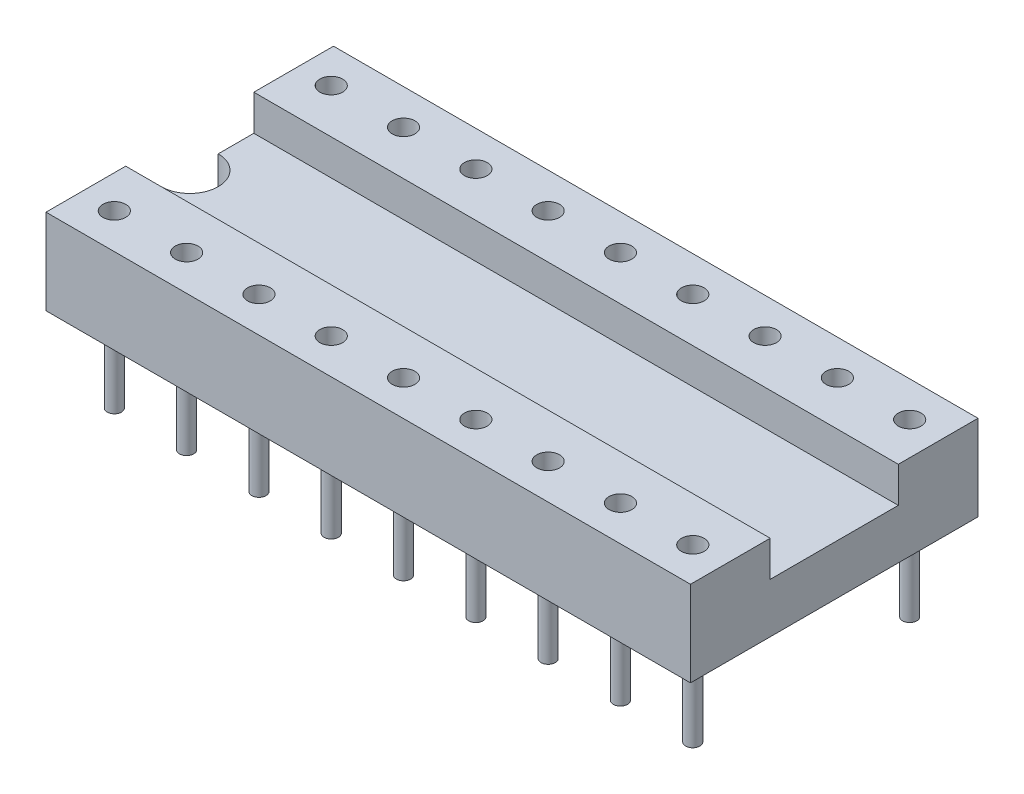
ISO-10303-21;
HEADER;
FILE_DESCRIPTION(('STEP AP214'),'2;1');
FILE_NAME('part.step','',(''),(''),'','','');
FILE_SCHEMA(('AUTOMOTIVE_DESIGN { 1 0 10303 214 1 1 1 1 }'));
ENDSEC;
DATA;
#1=APPLICATION_CONTEXT('core data for automotive mechanical design processes');
#2=APPLICATION_PROTOCOL_DEFINITION('international standard','automotive_design',2000,#1);
#3=PRODUCT_CONTEXT('',#1,'mechanical');
#4=PRODUCT('Part','Part','',(#3));
#5=PRODUCT_RELATED_PRODUCT_CATEGORY('part','',(#4));
#6=PRODUCT_DEFINITION_FORMATION('','',#4);
#7=PRODUCT_DEFINITION_CONTEXT('part definition',#1,'design');
#8=PRODUCT_DEFINITION('design','',#6,#7);
#9=PRODUCT_DEFINITION_SHAPE('','',#8);
#10=(LENGTH_UNIT() NAMED_UNIT(*) SI_UNIT(.MILLI.,.METRE.));
#11=(NAMED_UNIT(*) PLANE_ANGLE_UNIT() SI_UNIT($,.RADIAN.));
#12=(NAMED_UNIT(*) SI_UNIT($,.STERADIAN.) SOLID_ANGLE_UNIT());
#13=UNCERTAINTY_MEASURE_WITH_UNIT(LENGTH_MEASURE(1.E-05),#10,'distance_accuracy_value','');
#14=(GEOMETRIC_REPRESENTATION_CONTEXT(3) GLOBAL_UNCERTAINTY_ASSIGNED_CONTEXT((#13)) GLOBAL_UNIT_ASSIGNED_CONTEXT((#10,
#11,#12)) REPRESENTATION_CONTEXT('',''));
#15=CARTESIAN_POINT('',(0.,0.,0.));
#16=DIRECTION('',(0.,0.,1.));
#17=DIRECTION('',(1.,0.,0.));
#18=AXIS2_PLACEMENT_3D('',#15,#16,#17);
#19=CARTESIAN_POINT('',(22.64,0.,5.05));
#20=DIRECTION('',(0.,1.,0.));
#21=DIRECTION('',(0.,0.,1.));
#22=AXIS2_PLACEMENT_3D('',#19,#20,#21);
#23=PLANE('',#22);
#24=CARTESIAN_POINT('',(21.48,0.,3.81));
#25=DIRECTION('',(0.,1.,0.));
#26=DIRECTION('',(0.,0.,1.));
#27=AXIS2_PLACEMENT_3D('',#24,#25,#26);
#28=CIRCLE('',#27,0.25);
#29=CARTESIAN_POINT('',(21.48,0.,4.06));
#30=VERTEX_POINT('',#29);
#31=EDGE_CURVE('E40',#30,#30,#28,.F.);
#32=ORIENTED_EDGE('',*,*,#31,.F.);
#33=EDGE_LOOP('',(#32));
#34=FACE_BOUND('',#33,.T.);
#35=CARTESIAN_POINT('',(18.94,0.,3.81));
#36=DIRECTION('',(0.,1.,0.));
#37=DIRECTION('',(0.,0.,1.));
#38=AXIS2_PLACEMENT_3D('',#35,#36,#37);
#39=CIRCLE('',#38,0.25);
#40=CARTESIAN_POINT('',(18.94,0.,4.06));
#41=VERTEX_POINT('',#40);
#42=EDGE_CURVE('E217',#41,#41,#39,.F.);
#43=ORIENTED_EDGE('',*,*,#42,.F.);
#44=EDGE_LOOP('',(#43));
#45=FACE_BOUND('',#44,.T.);
#46=CARTESIAN_POINT('',(16.4,0.,3.81));
#47=DIRECTION('',(0.,1.,0.));
#48=DIRECTION('',(0.,0.,1.));
#49=AXIS2_PLACEMENT_3D('',#46,#47,#48);
#50=CIRCLE('',#49,0.25);
#51=CARTESIAN_POINT('',(16.4,0.,4.06));
#52=VERTEX_POINT('',#51);
#53=EDGE_CURVE('E211',#52,#52,#50,.F.);
#54=ORIENTED_EDGE('',*,*,#53,.F.);
#55=EDGE_LOOP('',(#54));
#56=FACE_BOUND('',#55,.T.);
#57=CARTESIAN_POINT('',(13.86,0.,3.81));
#58=DIRECTION('',(0.,1.,0.));
#59=DIRECTION('',(0.,0.,1.));
#60=AXIS2_PLACEMENT_3D('',#57,#58,#59);
#61=CIRCLE('',#60,0.25);
#62=CARTESIAN_POINT('',(13.86,0.,4.06));
#63=VERTEX_POINT('',#62);
#64=EDGE_CURVE('E205',#63,#63,#61,.F.);
#65=ORIENTED_EDGE('',*,*,#64,.F.);
#66=EDGE_LOOP('',(#65));
#67=FACE_BOUND('',#66,.T.);
#68=CARTESIAN_POINT('',(11.32,0.,3.81));
#69=DIRECTION('',(0.,1.,0.));
#70=DIRECTION('',(0.,0.,1.));
#71=AXIS2_PLACEMENT_3D('',#68,#69,#70);
#72=CIRCLE('',#71,0.25);
#73=CARTESIAN_POINT('',(11.32,0.,4.06));
#74=VERTEX_POINT('',#73);
#75=EDGE_CURVE('E199',#74,#74,#72,.F.);
#76=ORIENTED_EDGE('',*,*,#75,.F.);
#77=EDGE_LOOP('',(#76));
#78=FACE_BOUND('',#77,.T.);
#79=CARTESIAN_POINT('',(8.78,0.,3.81));
#80=DIRECTION('',(0.,1.,0.));
#81=DIRECTION('',(0.,0.,1.));
#82=AXIS2_PLACEMENT_3D('',#79,#80,#81);
#83=CIRCLE('',#82,0.25);
#84=CARTESIAN_POINT('',(8.78,0.,4.06));
#85=VERTEX_POINT('',#84);
#86=EDGE_CURVE('E193',#85,#85,#83,.F.);
#87=ORIENTED_EDGE('',*,*,#86,.F.);
#88=EDGE_LOOP('',(#87));
#89=FACE_BOUND('',#88,.T.);
#90=CARTESIAN_POINT('',(6.24,0.,3.81));
#91=DIRECTION('',(0.,1.,0.));
#92=DIRECTION('',(0.,0.,1.));
#93=AXIS2_PLACEMENT_3D('',#90,#91,#92);
#94=CIRCLE('',#93,0.249999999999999);
#95=CARTESIAN_POINT('',(6.24,0.,4.06));
#96=VERTEX_POINT('',#95);
#97=EDGE_CURVE('E187',#96,#96,#94,.F.);
#98=ORIENTED_EDGE('',*,*,#97,.F.);
#99=EDGE_LOOP('',(#98));
#100=FACE_BOUND('',#99,.T.);
#101=CARTESIAN_POINT('',(3.7,0.,3.81));
#102=DIRECTION('',(0.,1.,0.));
#103=DIRECTION('',(0.,0.,1.));
#104=AXIS2_PLACEMENT_3D('',#101,#102,#103);
#105=CIRCLE('',#104,0.249999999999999);
#106=CARTESIAN_POINT('',(3.7,0.,4.06));
#107=VERTEX_POINT('',#106);
#108=EDGE_CURVE('E181',#107,#107,#105,.F.);
#109=ORIENTED_EDGE('',*,*,#108,.F.);
#110=EDGE_LOOP('',(#109));
#111=FACE_BOUND('',#110,.T.);
#112=CARTESIAN_POINT('',(1.16,0.,3.81));
#113=DIRECTION('',(0.,1.,0.));
#114=DIRECTION('',(0.,0.,1.));
#115=AXIS2_PLACEMENT_3D('',#112,#113,#114);
#116=CIRCLE('',#115,0.25);
#117=CARTESIAN_POINT('',(1.16,0.,4.06));
#118=VERTEX_POINT('',#117);
#119=EDGE_CURVE('E175',#118,#118,#116,.F.);
#120=ORIENTED_EDGE('',*,*,#119,.F.);
#121=EDGE_LOOP('',(#120));
#122=FACE_BOUND('',#121,.T.);
#123=DIRECTION('',(0.,0.,-1.));
#124=VECTOR('',#123,1.);
#125=CARTESIAN_POINT('',(0.,0.,5.05));
#126=LINE('',#125,#124);
#127=CARTESIAN_POINT('',(0.,0.,5.05));
#128=VERTEX_POINT('',#127);
#129=CARTESIAN_POINT('',(0.,0.,1.));
#130=VERTEX_POINT('',#129);
#131=EDGE_CURVE('E153',#128,#130,#126,.T.);
#132=ORIENTED_EDGE('',*,*,#131,.T.);
#133=CARTESIAN_POINT('',(0.,0.,0.));
#134=DIRECTION('',(0.,1.,0.));
#135=DIRECTION('',(0.,0.,1.));
#136=AXIS2_PLACEMENT_3D('',#133,#134,#135);
#137=CIRCLE('',#136,1.);
#138=CARTESIAN_POINT('',(0.,0.,-1.));
#139=VERTEX_POINT('',#138);
#140=EDGE_CURVE('E47',#130,#139,#137,.T.);
#141=ORIENTED_EDGE('',*,*,#140,.T.);
#142=CARTESIAN_POINT('',(0.,0.,-5.05));
#143=VERTEX_POINT('',#142);
#144=EDGE_CURVE('E152',#139,#143,#126,.T.);
#145=ORIENTED_EDGE('',*,*,#144,.T.);
#146=DIRECTION('',(-1.,0.,0.));
#147=VECTOR('',#146,1.);
#148=CARTESIAN_POINT('',(22.64,0.,-5.05));
#149=LINE('',#148,#147);
#150=CARTESIAN_POINT('',(22.64,0.,-5.05));
#151=VERTEX_POINT('',#150);
#152=EDGE_CURVE('E133',#151,#143,#149,.T.);
#153=ORIENTED_EDGE('',*,*,#152,.F.);
#154=DIRECTION('',(0.,0.,-1.));
#155=VECTOR('',#154,1.);
#156=CARTESIAN_POINT('',(22.64,0.,5.05));
#157=LINE('',#156,#155);
#158=CARTESIAN_POINT('',(22.64,0.,5.05));
#159=VERTEX_POINT('',#158);
#160=EDGE_CURVE('E121',#159,#151,#157,.T.);
#161=ORIENTED_EDGE('',*,*,#160,.F.);
#162=DIRECTION('',(-1.,0.,0.));
#163=VECTOR('',#162,1.);
#164=CARTESIAN_POINT('',(22.64,0.,5.05));
#165=LINE('',#164,#163);
#166=EDGE_CURVE('E164',#159,#128,#165,.T.);
#167=ORIENTED_EDGE('',*,*,#166,.T.);
#168=EDGE_LOOP('',(#132,#141,#145,#153,#161,#167));
#169=FACE_BOUND('',#168,.T.);
#170=CARTESIAN_POINT('',(1.16,0.,-3.81));
#171=DIRECTION('',(0.,1.,0.));
#172=DIRECTION('',(0.,0.,1.));
#173=AXIS2_PLACEMENT_3D('',#170,#171,#172);
#174=CIRCLE('',#173,0.25);
#175=CARTESIAN_POINT('',(1.16,0.,-3.56));
#176=VERTEX_POINT('',#175);
#177=EDGE_CURVE('E178',#176,#176,#174,.F.);
#178=ORIENTED_EDGE('',*,*,#177,.F.);
#179=EDGE_LOOP('',(#178));
#180=FACE_BOUND('',#179,.T.);
#181=CARTESIAN_POINT('',(3.7,0.,-3.81));
#182=DIRECTION('',(0.,1.,0.));
#183=DIRECTION('',(0.,0.,1.));
#184=AXIS2_PLACEMENT_3D('',#181,#182,#183);
#185=CIRCLE('',#184,0.249999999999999);
#186=CARTESIAN_POINT('',(3.7,0.,-3.56));
#187=VERTEX_POINT('',#186);
#188=EDGE_CURVE('E184',#187,#187,#185,.F.);
#189=ORIENTED_EDGE('',*,*,#188,.F.);
#190=EDGE_LOOP('',(#189));
#191=FACE_BOUND('',#190,.T.);
#192=CARTESIAN_POINT('',(6.24,0.,-3.81));
#193=DIRECTION('',(0.,1.,0.));
#194=DIRECTION('',(0.,0.,1.));
#195=AXIS2_PLACEMENT_3D('',#192,#193,#194);
#196=CIRCLE('',#195,0.249999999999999);
#197=CARTESIAN_POINT('',(6.24,0.,-3.56));
#198=VERTEX_POINT('',#197);
#199=EDGE_CURVE('E190',#198,#198,#196,.F.);
#200=ORIENTED_EDGE('',*,*,#199,.F.);
#201=EDGE_LOOP('',(#200));
#202=FACE_BOUND('',#201,.T.);
#203=CARTESIAN_POINT('',(8.78,0.,-3.81));
#204=DIRECTION('',(0.,1.,0.));
#205=DIRECTION('',(0.,0.,1.));
#206=AXIS2_PLACEMENT_3D('',#203,#204,#205);
#207=CIRCLE('',#206,0.25);
#208=CARTESIAN_POINT('',(8.78,0.,-3.56));
#209=VERTEX_POINT('',#208);
#210=EDGE_CURVE('E196',#209,#209,#207,.F.);
#211=ORIENTED_EDGE('',*,*,#210,.F.);
#212=EDGE_LOOP('',(#211));
#213=FACE_BOUND('',#212,.T.);
#214=CARTESIAN_POINT('',(11.32,0.,-3.81));
#215=DIRECTION('',(0.,1.,0.));
#216=DIRECTION('',(0.,0.,1.));
#217=AXIS2_PLACEMENT_3D('',#214,#215,#216);
#218=CIRCLE('',#217,0.25);
#219=CARTESIAN_POINT('',(11.32,0.,-3.56));
#220=VERTEX_POINT('',#219);
#221=EDGE_CURVE('E202',#220,#220,#218,.F.);
#222=ORIENTED_EDGE('',*,*,#221,.F.);
#223=EDGE_LOOP('',(#222));
#224=FACE_BOUND('',#223,.T.);
#225=CARTESIAN_POINT('',(13.86,0.,-3.81));
#226=DIRECTION('',(0.,1.,0.));
#227=DIRECTION('',(0.,0.,1.));
#228=AXIS2_PLACEMENT_3D('',#225,#226,#227);
#229=CIRCLE('',#228,0.25);
#230=CARTESIAN_POINT('',(13.86,0.,-3.56));
#231=VERTEX_POINT('',#230);
#232=EDGE_CURVE('E208',#231,#231,#229,.F.);
#233=ORIENTED_EDGE('',*,*,#232,.F.);
#234=EDGE_LOOP('',(#233));
#235=FACE_BOUND('',#234,.T.);
#236=CARTESIAN_POINT('',(16.4,0.,-3.81));
#237=DIRECTION('',(0.,1.,0.));
#238=DIRECTION('',(0.,0.,1.));
#239=AXIS2_PLACEMENT_3D('',#236,#237,#238);
#240=CIRCLE('',#239,0.25);
#241=CARTESIAN_POINT('',(16.4,0.,-3.56));
#242=VERTEX_POINT('',#241);
#243=EDGE_CURVE('E214',#242,#242,#240,.F.);
#244=ORIENTED_EDGE('',*,*,#243,.F.);
#245=EDGE_LOOP('',(#244));
#246=FACE_BOUND('',#245,.T.);
#247=CARTESIAN_POINT('',(18.94,0.,-3.81));
#248=DIRECTION('',(0.,1.,0.));
#249=DIRECTION('',(0.,0.,1.));
#250=AXIS2_PLACEMENT_3D('',#247,#248,#249);
#251=CIRCLE('',#250,0.25);
#252=CARTESIAN_POINT('',(18.94,0.,-3.56));
#253=VERTEX_POINT('',#252);
#254=EDGE_CURVE('E220',#253,#253,#251,.F.);
#255=ORIENTED_EDGE('',*,*,#254,.F.);
#256=EDGE_LOOP('',(#255));
#257=FACE_BOUND('',#256,.T.);
#258=CARTESIAN_POINT('',(21.48,0.,-3.81));
#259=DIRECTION('',(0.,1.,0.));
#260=DIRECTION('',(0.,0.,1.));
#261=AXIS2_PLACEMENT_3D('',#258,#259,#260);
#262=CIRCLE('',#261,0.25);
#263=CARTESIAN_POINT('',(21.48,0.,-3.56));
#264=VERTEX_POINT('',#263);
#265=EDGE_CURVE('E11',#264,#264,#262,.F.);
#266=ORIENTED_EDGE('',*,*,#265,.F.);
#267=EDGE_LOOP('',(#266));
#268=FACE_BOUND('',#267,.T.);
#269=ADVANCED_FACE('F32',(#34,#45,#56,#67,#78,#89,#100,#111,#122,#169,#180,#191,#202,#213,#224,
#235,#246,#257,#268),#23,.F.);
#270=CARTESIAN_POINT('',(0.,1.75,5.05));
#271=DIRECTION('',(1.,0.,0.));
#272=DIRECTION('',(0.,0.,-1.));
#273=AXIS2_PLACEMENT_3D('',#270,#271,#272);
#274=PLANE('',#273);
#275=ORIENTED_EDGE('',*,*,#144,.F.);
#276=DIRECTION('',(0.,1.,0.));
#277=VECTOR('',#276,1.);
#278=CARTESIAN_POINT('',(0.,0.,-1.));
#279=LINE('',#278,#277);
#280=CARTESIAN_POINT('',(0.,1.75,-1.));
#281=VERTEX_POINT('',#280);
#282=EDGE_CURVE('E605',#139,#281,#279,.T.);
#283=ORIENTED_EDGE('',*,*,#282,.T.);
#284=DIRECTION('',(0.,0.,1.));
#285=VECTOR('',#284,1.);
#286=CARTESIAN_POINT('',(0.,1.75,-2.25));
#287=LINE('',#286,#285);
#288=CARTESIAN_POINT('',(0.,1.75,-2.25));
#289=VERTEX_POINT('',#288);
#290=EDGE_CURVE('E142',#289,#281,#287,.T.);
#291=ORIENTED_EDGE('',*,*,#290,.F.);
#292=DIRECTION('',(0.,-1.,0.));
#293=VECTOR('',#292,1.);
#294=CARTESIAN_POINT('',(0.,3.,-2.25));
#295=LINE('',#294,#293);
#296=CARTESIAN_POINT('',(0.,3.,-2.25));
#297=VERTEX_POINT('',#296);
#298=EDGE_CURVE('E89',#297,#289,#295,.T.);
#299=ORIENTED_EDGE('',*,*,#298,.F.);
#300=DIRECTION('',(0.,0.,1.));
#301=VECTOR('',#300,1.);
#302=CARTESIAN_POINT('',(0.,3.,-5.05));
#303=LINE('',#302,#301);
#304=CARTESIAN_POINT('',(0.,3.,-5.05));
#305=VERTEX_POINT('',#304);
#306=EDGE_CURVE('E157',#305,#297,#303,.T.);
#307=ORIENTED_EDGE('',*,*,#306,.F.);
#308=DIRECTION('',(0.,1.,0.));
#309=VECTOR('',#308,1.);
#310=CARTESIAN_POINT('',(0.,0.,-5.05));
#311=LINE('',#310,#309);
#312=EDGE_CURVE('E130',#143,#305,#311,.T.);
#313=ORIENTED_EDGE('',*,*,#312,.F.);
#314=EDGE_LOOP('',(#275,#283,#291,#299,#307,#313));
#315=FACE_BOUND('',#314,.T.);
#316=ADVANCED_FACE('F229',(#315),#274,.F.);
#317=CARTESIAN_POINT('',(22.64,1.75,-2.25));
#318=DIRECTION('',(0.,-1.,0.));
#319=DIRECTION('',(0.,0.,-1.));
#320=AXIS2_PLACEMENT_3D('',#317,#318,#319);
#321=PLANE('',#320);
#322=ORIENTED_EDGE('',*,*,#290,.T.);
#323=CARTESIAN_POINT('',(0.,1.75,0.));
#324=DIRECTION('',(0.,1.,0.));
#325=DIRECTION('',(0.,0.,1.));
#326=AXIS2_PLACEMENT_3D('',#323,#324,#325);
#327=CIRCLE('',#326,1.);
#328=CARTESIAN_POINT('',(0.,1.75,1.));
#329=VERTEX_POINT('',#328);
#330=EDGE_CURVE('E610',#329,#281,#327,.T.);
#331=ORIENTED_EDGE('',*,*,#330,.F.);
#332=CARTESIAN_POINT('',(0.,1.75,2.25));
#333=VERTEX_POINT('',#332);
#334=EDGE_CURVE('E146',#329,#333,#287,.T.);
#335=ORIENTED_EDGE('',*,*,#334,.T.);
#336=DIRECTION('',(-1.,0.,0.));
#337=VECTOR('',#336,1.);
#338=CARTESIAN_POINT('',(22.64,1.75,2.25));
#339=LINE('',#338,#337);
#340=CARTESIAN_POINT('',(22.64,1.75,2.25));
#341=VERTEX_POINT('',#340);
#342=EDGE_CURVE('E173',#341,#333,#339,.T.);
#343=ORIENTED_EDGE('',*,*,#342,.F.);
#344=DIRECTION('',(0.,0.,1.));
#345=VECTOR('',#344,1.);
#346=CARTESIAN_POINT('',(22.64,1.75,-2.25));
#347=LINE('',#346,#345);
#348=CARTESIAN_POINT('',(22.64,1.75,-2.25));
#349=VERTEX_POINT('',#348);
#350=EDGE_CURVE('E160',#349,#341,#347,.T.);
#351=ORIENTED_EDGE('',*,*,#350,.F.);
#352=DIRECTION('',(-1.,0.,0.));
#353=VECTOR('',#352,1.);
#354=CARTESIAN_POINT('',(22.64,1.75,-2.25));
#355=LINE('',#354,#353);
#356=EDGE_CURVE('E138',#349,#289,#355,.T.);
#357=ORIENTED_EDGE('',*,*,#356,.T.);
#358=EDGE_LOOP('',(#322,#331,#335,#343,#351,#357));
#359=FACE_BOUND('',#358,.T.);
#360=ADVANCED_FACE('F34',(#359),#321,.F.);
#361=CARTESIAN_POINT('',(22.64,1.75,2.25));
#362=DIRECTION('',(0.,0.,1.));
#363=DIRECTION('',(0.,-1.,0.));
#364=AXIS2_PLACEMENT_3D('',#361,#362,#363);
#365=PLANE('',#364);
#366=DIRECTION('',(0.,1.,0.));
#367=VECTOR('',#366,1.);
#368=CARTESIAN_POINT('',(0.,1.75,2.25));
#369=LINE('',#368,#367);
#370=CARTESIAN_POINT('',(0.,3.,2.25));
#371=VERTEX_POINT('',#370);
#372=EDGE_CURVE('E145',#333,#371,#369,.T.);
#373=ORIENTED_EDGE('',*,*,#372,.T.);
#374=DIRECTION('',(-1.,0.,0.));
#375=VECTOR('',#374,1.);
#376=CARTESIAN_POINT('',(22.64,3.,2.25));
#377=LINE('',#376,#375);
#378=CARTESIAN_POINT('',(22.64,3.,2.25));
#379=VERTEX_POINT('',#378);
#380=EDGE_CURVE('E170',#379,#371,#377,.T.);
#381=ORIENTED_EDGE('',*,*,#380,.F.);
#382=DIRECTION('',(0.,1.,0.));
#383=VECTOR('',#382,1.);
#384=CARTESIAN_POINT('',(22.64,1.75,2.25));
#385=LINE('',#384,#383);
#386=EDGE_CURVE('E98',#341,#379,#385,.T.);
#387=ORIENTED_EDGE('',*,*,#386,.F.);
#388=ORIENTED_EDGE('',*,*,#342,.T.);
#389=EDGE_LOOP('',(#373,#381,#387,#388));
#390=FACE_BOUND('',#389,.T.);
#391=ADVANCED_FACE('F581',(#390),#365,.F.);
#392=CARTESIAN_POINT('',(22.64,3.,2.25));
#393=DIRECTION('',(0.,-1.,0.));
#394=DIRECTION('',(0.,0.,-1.));
#395=AXIS2_PLACEMENT_3D('',#392,#393,#394);
#396=PLANE('',#395);
#397=CARTESIAN_POINT('',(21.48,3.,3.80999999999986));
#398=DIRECTION('',(0.,1.,0.));
#399=DIRECTION('',(0.,0.,1.));
#400=AXIS2_PLACEMENT_3D('',#397,#398,#399);
#401=CIRCLE('',#400,0.400000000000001);
#402=CARTESIAN_POINT('',(21.48,3.,4.20999999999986));
#403=VERTEX_POINT('',#402);
#404=EDGE_CURVE('E711',#403,#403,#401,.T.);
#405=ORIENTED_EDGE('',*,*,#404,.F.);
#406=EDGE_LOOP('',(#405));
#407=FACE_BOUND('',#406,.T.);
#408=CARTESIAN_POINT('',(18.94,3.,3.80999999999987));
#409=DIRECTION('',(0.,1.,0.));
#410=DIRECTION('',(0.,0.,1.));
#411=AXIS2_PLACEMENT_3D('',#408,#409,#410);
#412=CIRCLE('',#411,0.400000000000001);
#413=CARTESIAN_POINT('',(18.94,3.,4.20999999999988));
#414=VERTEX_POINT('',#413);
#415=EDGE_CURVE('E699',#414,#414,#412,.T.);
#416=ORIENTED_EDGE('',*,*,#415,.F.);
#417=EDGE_LOOP('',(#416));
#418=FACE_BOUND('',#417,.T.);
#419=CARTESIAN_POINT('',(16.4,3.,3.80999999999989));
#420=DIRECTION('',(0.,1.,0.));
#421=DIRECTION('',(0.,0.,1.));
#422=AXIS2_PLACEMENT_3D('',#419,#420,#421);
#423=CIRCLE('',#422,0.400000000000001);
#424=CARTESIAN_POINT('',(16.4,3.,4.20999999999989));
#425=VERTEX_POINT('',#424);
#426=EDGE_CURVE('E687',#425,#425,#423,.T.);
#427=ORIENTED_EDGE('',*,*,#426,.F.);
#428=EDGE_LOOP('',(#427));
#429=FACE_BOUND('',#428,.T.);
#430=CARTESIAN_POINT('',(13.86,3.,3.80999999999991));
#431=DIRECTION('',(0.,1.,0.));
#432=DIRECTION('',(0.,0.,1.));
#433=AXIS2_PLACEMENT_3D('',#430,#431,#432);
#434=CIRCLE('',#433,0.399999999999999);
#435=CARTESIAN_POINT('',(13.86,3.,4.20999999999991));
#436=VERTEX_POINT('',#435);
#437=EDGE_CURVE('E675',#436,#436,#434,.T.);
#438=ORIENTED_EDGE('',*,*,#437,.F.);
#439=EDGE_LOOP('',(#438));
#440=FACE_BOUND('',#439,.T.);
#441=CARTESIAN_POINT('',(11.32,3.,3.80999999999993));
#442=DIRECTION('',(0.,1.,0.));
#443=DIRECTION('',(0.,0.,1.));
#444=AXIS2_PLACEMENT_3D('',#441,#442,#443);
#445=CIRCLE('',#444,0.399999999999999);
#446=CARTESIAN_POINT('',(11.32,3.,4.20999999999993));
#447=VERTEX_POINT('',#446);
#448=EDGE_CURVE('E663',#447,#447,#445,.T.);
#449=ORIENTED_EDGE('',*,*,#448,.F.);
#450=EDGE_LOOP('',(#449));
#451=FACE_BOUND('',#450,.T.);
#452=CARTESIAN_POINT('',(8.78,3.,3.80999999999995));
#453=DIRECTION('',(0.,1.,0.));
#454=DIRECTION('',(0.,0.,1.));
#455=AXIS2_PLACEMENT_3D('',#452,#453,#454);
#456=CIRCLE('',#455,0.4);
#457=CARTESIAN_POINT('',(8.78,3.,4.20999999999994));
#458=VERTEX_POINT('',#457);
#459=EDGE_CURVE('E651',#458,#458,#456,.T.);
#460=ORIENTED_EDGE('',*,*,#459,.F.);
#461=EDGE_LOOP('',(#460));
#462=FACE_BOUND('',#461,.T.);
#463=CARTESIAN_POINT('',(6.24,3.,3.80999999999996));
#464=DIRECTION('',(0.,1.,0.));
#465=DIRECTION('',(0.,0.,1.));
#466=AXIS2_PLACEMENT_3D('',#463,#464,#465);
#467=CIRCLE('',#466,0.4);
#468=CARTESIAN_POINT('',(6.24,3.,4.20999999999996));
#469=VERTEX_POINT('',#468);
#470=EDGE_CURVE('E639',#469,#469,#467,.T.);
#471=ORIENTED_EDGE('',*,*,#470,.F.);
#472=EDGE_LOOP('',(#471));
#473=FACE_BOUND('',#472,.T.);
#474=CARTESIAN_POINT('',(3.7,3.,3.80999999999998));
#475=DIRECTION('',(0.,1.,0.));
#476=DIRECTION('',(0.,0.,1.));
#477=AXIS2_PLACEMENT_3D('',#474,#475,#476);
#478=CIRCLE('',#477,0.4);
#479=CARTESIAN_POINT('',(3.7,3.,4.20999999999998));
#480=VERTEX_POINT('',#479);
#481=EDGE_CURVE('E627',#480,#480,#478,.T.);
#482=ORIENTED_EDGE('',*,*,#481,.F.);
#483=EDGE_LOOP('',(#482));
#484=FACE_BOUND('',#483,.T.);
#485=CARTESIAN_POINT('',(1.16,3.,3.81));
#486=DIRECTION('',(0.,1.,0.));
#487=DIRECTION('',(0.,0.,1.));
#488=AXIS2_PLACEMENT_3D('',#485,#486,#487);
#489=CIRCLE('',#488,0.4);
#490=CARTESIAN_POINT('',(1.16,3.,4.21));
#491=VERTEX_POINT('',#490);
#492=EDGE_CURVE('E615',#491,#491,#489,.T.);
#493=ORIENTED_EDGE('',*,*,#492,.F.);
#494=EDGE_LOOP('',(#493));
#495=FACE_BOUND('',#494,.T.);
#496=DIRECTION('',(0.,0.,1.));
#497=VECTOR('',#496,1.);
#498=CARTESIAN_POINT('',(0.,3.,2.25));
#499=LINE('',#498,#497);
#500=CARTESIAN_POINT('',(0.,3.,5.05));
#501=VERTEX_POINT('',#500);
#502=EDGE_CURVE('E148',#371,#501,#499,.T.);
#503=ORIENTED_EDGE('',*,*,#502,.T.);
#504=DIRECTION('',(-1.,0.,0.));
#505=VECTOR('',#504,1.);
#506=CARTESIAN_POINT('',(22.64,3.,5.05));
#507=LINE('',#506,#505);
#508=CARTESIAN_POINT('',(22.64,3.,5.05));
#509=VERTEX_POINT('',#508);
#510=EDGE_CURVE('E167',#509,#501,#507,.T.);
#511=ORIENTED_EDGE('',*,*,#510,.F.);
#512=DIRECTION('',(0.,0.,1.));
#513=VECTOR('',#512,1.);
#514=CARTESIAN_POINT('',(22.64,3.,2.25));
#515=LINE('',#514,#513);
#516=EDGE_CURVE('E595',#379,#509,#515,.T.);
#517=ORIENTED_EDGE('',*,*,#516,.F.);
#518=ORIENTED_EDGE('',*,*,#380,.T.);
#519=EDGE_LOOP('',(#503,#511,#517,#518));
#520=FACE_BOUND('',#519,.T.);
#521=ADVANCED_FACE('F578',(#407,#418,#429,#440,#451,#462,#473,#484,#495,#520),#396,.F.);
#522=CARTESIAN_POINT('',(22.64,3.,5.05));
#523=DIRECTION('',(0.,0.,-1.));
#524=DIRECTION('',(-1.,0.,0.));
#525=AXIS2_PLACEMENT_3D('',#522,#523,#524);
#526=PLANE('',#525);
#527=DIRECTION('',(0.,-1.,0.));
#528=VECTOR('',#527,1.);
#529=CARTESIAN_POINT('',(0.,3.,5.05));
#530=LINE('',#529,#528);
#531=EDGE_CURVE('E150',#501,#128,#530,.T.);
#532=ORIENTED_EDGE('',*,*,#531,.T.);
#533=ORIENTED_EDGE('',*,*,#166,.F.);
#534=DIRECTION('',(0.,-1.,0.));
#535=VECTOR('',#534,1.);
#536=CARTESIAN_POINT('',(22.64,3.,5.05));
#537=LINE('',#536,#535);
#538=EDGE_CURVE('E599',#509,#159,#537,.T.);
#539=ORIENTED_EDGE('',*,*,#538,.F.);
#540=ORIENTED_EDGE('',*,*,#510,.T.);
#541=EDGE_LOOP('',(#532,#533,#539,#540));
#542=FACE_BOUND('',#541,.T.);
#543=ADVANCED_FACE('F574',(#542),#526,.F.);
#544=CARTESIAN_POINT('',(22.64,0.,-5.05));
#545=DIRECTION('',(0.,0.,1.));
#546=DIRECTION('',(0.,-1.,0.));
#547=AXIS2_PLACEMENT_3D('',#544,#545,#546);
#548=PLANE('',#547);
#549=ORIENTED_EDGE('',*,*,#312,.T.);
#550=DIRECTION('',(-1.,0.,0.));
#551=VECTOR('',#550,1.);
#552=CARTESIAN_POINT('',(22.64,3.,-5.05));
#553=LINE('',#552,#551);
#554=CARTESIAN_POINT('',(22.64,3.,-5.05));
#555=VERTEX_POINT('',#554);
#556=EDGE_CURVE('E127',#555,#305,#553,.T.);
#557=ORIENTED_EDGE('',*,*,#556,.F.);
#558=DIRECTION('',(0.,1.,0.));
#559=VECTOR('',#558,1.);
#560=CARTESIAN_POINT('',(22.64,0.,-5.05));
#561=LINE('',#560,#559);
#562=EDGE_CURVE('E114',#151,#555,#561,.T.);
#563=ORIENTED_EDGE('',*,*,#562,.F.);
#564=ORIENTED_EDGE('',*,*,#152,.T.);
#565=EDGE_LOOP('',(#549,#557,#563,#564));
#566=FACE_BOUND('',#565,.T.);
#567=ADVANCED_FACE('F128',(#566),#548,.F.);
#568=CARTESIAN_POINT('',(22.64,3.,-5.05));
#569=DIRECTION('',(0.,-1.,0.));
#570=DIRECTION('',(0.,0.,-1.));
#571=AXIS2_PLACEMENT_3D('',#568,#569,#570);
#572=PLANE('',#571);
#573=CARTESIAN_POINT('',(21.48,3.,-3.81000000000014));
#574=DIRECTION('',(0.,1.,0.));
#575=DIRECTION('',(0.,0.,-1.));
#576=AXIS2_PLACEMENT_3D('',#573,#574,#575);
#577=CIRCLE('',#576,0.400000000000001);
#578=CARTESIAN_POINT('',(21.48,3.,-4.21000000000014));
#579=VERTEX_POINT('',#578);
#580=EDGE_CURVE('E717',#579,#579,#577,.T.);
#581=ORIENTED_EDGE('',*,*,#580,.F.);
#582=EDGE_LOOP('',(#581));
#583=FACE_BOUND('',#582,.T.);
#584=CARTESIAN_POINT('',(18.94,3.,-3.81000000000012));
#585=DIRECTION('',(0.,1.,0.));
#586=DIRECTION('',(0.,0.,-1.));
#587=AXIS2_PLACEMENT_3D('',#584,#585,#586);
#588=CIRCLE('',#587,0.400000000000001);
#589=CARTESIAN_POINT('',(18.94,3.,-4.21000000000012));
#590=VERTEX_POINT('',#589);
#591=EDGE_CURVE('E705',#590,#590,#588,.T.);
#592=ORIENTED_EDGE('',*,*,#591,.F.);
#593=EDGE_LOOP('',(#592));
#594=FACE_BOUND('',#593,.T.);
#595=CARTESIAN_POINT('',(16.4,3.,-3.8100000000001));
#596=DIRECTION('',(0.,1.,0.));
#597=DIRECTION('',(0.,0.,-1.));
#598=AXIS2_PLACEMENT_3D('',#595,#596,#597);
#599=CIRCLE('',#598,0.400000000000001);
#600=CARTESIAN_POINT('',(16.4,3.,-4.21000000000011));
#601=VERTEX_POINT('',#600);
#602=EDGE_CURVE('E693',#601,#601,#599,.T.);
#603=ORIENTED_EDGE('',*,*,#602,.F.);
#604=EDGE_LOOP('',(#603));
#605=FACE_BOUND('',#604,.T.);
#606=CARTESIAN_POINT('',(13.86,3.,-3.81000000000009));
#607=DIRECTION('',(0.,1.,0.));
#608=DIRECTION('',(0.,0.,-1.));
#609=AXIS2_PLACEMENT_3D('',#606,#607,#608);
#610=CIRCLE('',#609,0.399999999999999);
#611=CARTESIAN_POINT('',(13.86,3.,-4.21000000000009));
#612=VERTEX_POINT('',#611);
#613=EDGE_CURVE('E681',#612,#612,#610,.T.);
#614=ORIENTED_EDGE('',*,*,#613,.F.);
#615=EDGE_LOOP('',(#614));
#616=FACE_BOUND('',#615,.T.);
#617=CARTESIAN_POINT('',(11.32,3.,-3.81000000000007));
#618=DIRECTION('',(0.,1.,0.));
#619=DIRECTION('',(0.,0.,-1.));
#620=AXIS2_PLACEMENT_3D('',#617,#618,#619);
#621=CIRCLE('',#620,0.399999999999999);
#622=CARTESIAN_POINT('',(11.32,3.,-4.21000000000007));
#623=VERTEX_POINT('',#622);
#624=EDGE_CURVE('E669',#623,#623,#621,.T.);
#625=ORIENTED_EDGE('',*,*,#624,.F.);
#626=EDGE_LOOP('',(#625));
#627=FACE_BOUND('',#626,.T.);
#628=CARTESIAN_POINT('',(8.78,3.,-3.81000000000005));
#629=DIRECTION('',(0.,1.,0.));
#630=DIRECTION('',(0.,0.,-1.));
#631=AXIS2_PLACEMENT_3D('',#628,#629,#630);
#632=CIRCLE('',#631,0.399999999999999);
#633=CARTESIAN_POINT('',(8.78,3.,-4.21000000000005));
#634=VERTEX_POINT('',#633);
#635=EDGE_CURVE('E657',#634,#634,#632,.T.);
#636=ORIENTED_EDGE('',*,*,#635,.F.);
#637=EDGE_LOOP('',(#636));
#638=FACE_BOUND('',#637,.T.);
#639=CARTESIAN_POINT('',(6.24,3.,-3.81000000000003));
#640=DIRECTION('',(0.,1.,0.));
#641=DIRECTION('',(0.,0.,-1.));
#642=AXIS2_PLACEMENT_3D('',#639,#640,#641);
#643=CIRCLE('',#642,0.4);
#644=CARTESIAN_POINT('',(6.24,3.,-4.21000000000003));
#645=VERTEX_POINT('',#644);
#646=EDGE_CURVE('E645',#645,#645,#643,.T.);
#647=ORIENTED_EDGE('',*,*,#646,.F.);
#648=EDGE_LOOP('',(#647));
#649=FACE_BOUND('',#648,.T.);
#650=CARTESIAN_POINT('',(3.7,3.,-3.81000000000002));
#651=DIRECTION('',(0.,1.,0.));
#652=DIRECTION('',(0.,0.,-1.));
#653=AXIS2_PLACEMENT_3D('',#650,#651,#652);
#654=CIRCLE('',#653,0.4);
#655=CARTESIAN_POINT('',(3.7,3.,-4.21000000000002));
#656=VERTEX_POINT('',#655);
#657=EDGE_CURVE('E633',#656,#656,#654,.T.);
#658=ORIENTED_EDGE('',*,*,#657,.F.);
#659=EDGE_LOOP('',(#658));
#660=FACE_BOUND('',#659,.T.);
#661=CARTESIAN_POINT('',(1.16,3.,-3.81));
#662=DIRECTION('',(0.,1.,0.));
#663=DIRECTION('',(0.,0.,-1.));
#664=AXIS2_PLACEMENT_3D('',#661,#662,#663);
#665=CIRCLE('',#664,0.4);
#666=CARTESIAN_POINT('',(1.16,3.,-4.21));
#667=VERTEX_POINT('',#666);
#668=EDGE_CURVE('E621',#667,#667,#665,.T.);
#669=ORIENTED_EDGE('',*,*,#668,.F.);
#670=EDGE_LOOP('',(#669));
#671=FACE_BOUND('',#670,.T.);
#672=ORIENTED_EDGE('',*,*,#306,.T.);
#673=DIRECTION('',(-1.,0.,0.));
#674=VECTOR('',#673,1.);
#675=CARTESIAN_POINT('',(22.64,3.,-2.25));
#676=LINE('',#675,#674);
#677=CARTESIAN_POINT('',(22.64,3.,-2.25));
#678=VERTEX_POINT('',#677);
#679=EDGE_CURVE('E134',#678,#297,#676,.T.);
#680=ORIENTED_EDGE('',*,*,#679,.F.);
#681=DIRECTION('',(0.,0.,1.));
#682=VECTOR('',#681,1.);
#683=CARTESIAN_POINT('',(22.64,3.,-5.05));
#684=LINE('',#683,#682);
#685=EDGE_CURVE('E118',#555,#678,#684,.T.);
#686=ORIENTED_EDGE('',*,*,#685,.F.);
#687=ORIENTED_EDGE('',*,*,#556,.T.);
#688=EDGE_LOOP('',(#672,#680,#686,#687));
#689=FACE_BOUND('',#688,.T.);
#690=ADVANCED_FACE('F136',(#583,#594,#605,#616,#627,#638,#649,#660,#671,#689),#572,.F.);
#691=CARTESIAN_POINT('',(22.64,3.,-2.25));
#692=DIRECTION('',(0.,0.,-1.));
#693=DIRECTION('',(0.,1.,0.));
#694=AXIS2_PLACEMENT_3D('',#691,#692,#693);
#695=PLANE('',#694);
#696=ORIENTED_EDGE('',*,*,#298,.T.);
#697=ORIENTED_EDGE('',*,*,#356,.F.);
#698=DIRECTION('',(0.,-1.,0.));
#699=VECTOR('',#698,1.);
#700=CARTESIAN_POINT('',(22.64,3.,-2.25));
#701=LINE('',#700,#699);
#702=EDGE_CURVE('E56',#678,#349,#701,.T.);
#703=ORIENTED_EDGE('',*,*,#702,.F.);
#704=ORIENTED_EDGE('',*,*,#679,.T.);
#705=EDGE_LOOP('',(#696,#697,#703,#704));
#706=FACE_BOUND('',#705,.T.);
#707=ADVANCED_FACE('F564',(#706),#695,.F.);
#708=CARTESIAN_POINT('',(22.64,1.75,5.05));
#709=DIRECTION('',(1.,0.,0.));
#710=DIRECTION('',(0.,0.,-1.));
#711=AXIS2_PLACEMENT_3D('',#708,#709,#710);
#712=PLANE('',#711);
#713=ORIENTED_EDGE('',*,*,#350,.T.);
#714=ORIENTED_EDGE('',*,*,#386,.T.);
#715=ORIENTED_EDGE('',*,*,#516,.T.);
#716=ORIENTED_EDGE('',*,*,#538,.T.);
#717=ORIENTED_EDGE('',*,*,#160,.T.);
#718=ORIENTED_EDGE('',*,*,#562,.T.);
#719=ORIENTED_EDGE('',*,*,#685,.T.);
#720=ORIENTED_EDGE('',*,*,#702,.T.);
#721=EDGE_LOOP('',(#713,#714,#715,#716,#717,#718,#719,#720));
#722=FACE_BOUND('',#721,.T.);
#723=ADVANCED_FACE('F116',(#722),#712,.T.);
#724=ORIENTED_EDGE('',*,*,#334,.F.);
#725=DIRECTION('',(0.,1.,0.));
#726=VECTOR('',#725,1.);
#727=CARTESIAN_POINT('',(0.,0.,1.));
#728=LINE('',#727,#726);
#729=EDGE_CURVE('E608',#130,#329,#728,.T.);
#730=ORIENTED_EDGE('',*,*,#729,.F.);
#731=ORIENTED_EDGE('',*,*,#131,.F.);
#732=ORIENTED_EDGE('',*,*,#531,.F.);
#733=ORIENTED_EDGE('',*,*,#502,.F.);
#734=ORIENTED_EDGE('',*,*,#372,.F.);
#735=EDGE_LOOP('',(#724,#730,#731,#732,#733,#734));
#736=FACE_BOUND('',#735,.T.);
#737=ADVANCED_FACE('F561',(#736),#274,.F.);
#738=CARTESIAN_POINT('',(0.,0.,0.));
#739=DIRECTION('',(0.,1.,0.));
#740=DIRECTION('',(0.,0.,1.));
#741=AXIS2_PLACEMENT_3D('',#738,#739,#740);
#742=CYLINDRICAL_SURFACE('',#741,1.);
#743=ORIENTED_EDGE('',*,*,#330,.T.);
#744=ORIENTED_EDGE('',*,*,#282,.F.);
#745=ORIENTED_EDGE('',*,*,#140,.F.);
#746=ORIENTED_EDGE('',*,*,#729,.T.);
#747=EDGE_LOOP('',(#743,#744,#745,#746));
#748=FACE_BOUND('',#747,.T.);
#749=ADVANCED_FACE('F557',(#748),#742,.F.);
#750=CARTESIAN_POINT('',(1.16,0.5,3.81));
#751=DIRECTION('',(0.,1.,0.));
#752=DIRECTION('',(0.,0.,1.));
#753=AXIS2_PLACEMENT_3D('',#750,#751,#752);
#754=CYLINDRICAL_SURFACE('',#753,0.4);
#755=CARTESIAN_POINT('',(1.16,0.5,3.81));
#756=DIRECTION('',(0.,1.,0.));
#757=DIRECTION('',(0.,0.,1.));
#758=AXIS2_PLACEMENT_3D('',#755,#756,#757);
#759=CIRCLE('',#758,0.4);
#760=CARTESIAN_POINT('',(1.16,0.5,4.21));
#761=VERTEX_POINT('',#760);
#762=EDGE_CURVE('E613',#761,#761,#759,.T.);
#763=ORIENTED_EDGE('',*,*,#762,.F.);
#764=EDGE_LOOP('',(#763));
#765=FACE_BOUND('',#764,.T.);
#766=ORIENTED_EDGE('',*,*,#492,.T.);
#767=EDGE_LOOP('',(#766));
#768=FACE_BOUND('',#767,.T.);
#769=ADVANCED_FACE('F553',(#765,#768),#754,.F.);
#770=CARTESIAN_POINT('',(1.16,0.5,3.81));
#771=DIRECTION('',(0.,1.,0.));
#772=DIRECTION('',(0.,0.,1.));
#773=AXIS2_PLACEMENT_3D('',#770,#771,#772);
#774=PLANE('',#773);
#775=ORIENTED_EDGE('',*,*,#762,.T.);
#776=EDGE_LOOP('',(#775));
#777=FACE_BOUND('',#776,.T.);
#778=ADVANCED_FACE('F549',(#777),#774,.T.);
#779=CARTESIAN_POINT('',(1.16,0.5,-3.81));
#780=DIRECTION('',(0.,1.,0.));
#781=DIRECTION('',(0.,0.,1.));
#782=AXIS2_PLACEMENT_3D('',#779,#780,#781);
#783=CYLINDRICAL_SURFACE('',#782,0.4);
#784=CARTESIAN_POINT('',(1.16,0.5,-3.81));
#785=DIRECTION('',(0.,1.,0.));
#786=DIRECTION('',(0.,0.,-1.));
#787=AXIS2_PLACEMENT_3D('',#784,#785,#786);
#788=CIRCLE('',#787,0.4);
#789=CARTESIAN_POINT('',(1.16,0.5,-4.21));
#790=VERTEX_POINT('',#789);
#791=EDGE_CURVE('E618',#790,#790,#788,.T.);
#792=ORIENTED_EDGE('',*,*,#791,.F.);
#793=EDGE_LOOP('',(#792));
#794=FACE_BOUND('',#793,.T.);
#795=ORIENTED_EDGE('',*,*,#668,.T.);
#796=EDGE_LOOP('',(#795));
#797=FACE_BOUND('',#796,.T.);
#798=ADVANCED_FACE('F545',(#794,#797),#783,.F.);
#799=CARTESIAN_POINT('',(1.16,0.5,-3.81));
#800=DIRECTION('',(0.,-1.,0.));
#801=DIRECTION('',(0.,0.,-1.));
#802=AXIS2_PLACEMENT_3D('',#799,#800,#801);
#803=PLANE('',#802);
#804=ORIENTED_EDGE('',*,*,#791,.T.);
#805=EDGE_LOOP('',(#804));
#806=FACE_BOUND('',#805,.T.);
#807=ADVANCED_FACE('F541',(#806),#803,.F.);
#808=CARTESIAN_POINT('',(3.7,0.5,3.80999999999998));
#809=DIRECTION('',(0.,1.,0.));
#810=DIRECTION('',(0.,0.,1.));
#811=AXIS2_PLACEMENT_3D('',#808,#809,#810);
#812=CYLINDRICAL_SURFACE('',#811,0.4);
#813=CARTESIAN_POINT('',(3.7,0.5,3.80999999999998));
#814=DIRECTION('',(0.,1.,0.));
#815=DIRECTION('',(0.,0.,1.));
#816=AXIS2_PLACEMENT_3D('',#813,#814,#815);
#817=CIRCLE('',#816,0.4);
#818=CARTESIAN_POINT('',(3.7,0.5,4.20999999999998));
#819=VERTEX_POINT('',#818);
#820=EDGE_CURVE('E624',#819,#819,#817,.T.);
#821=ORIENTED_EDGE('',*,*,#820,.F.);
#822=EDGE_LOOP('',(#821));
#823=FACE_BOUND('',#822,.T.);
#824=ORIENTED_EDGE('',*,*,#481,.T.);
#825=EDGE_LOOP('',(#824));
#826=FACE_BOUND('',#825,.T.);
#827=ADVANCED_FACE('F537',(#823,#826),#812,.F.);
#828=CARTESIAN_POINT('',(3.7,0.5,3.80999999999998));
#829=DIRECTION('',(0.,1.,0.));
#830=DIRECTION('',(0.,0.,1.));
#831=AXIS2_PLACEMENT_3D('',#828,#829,#830);
#832=PLANE('',#831);
#833=ORIENTED_EDGE('',*,*,#820,.T.);
#834=EDGE_LOOP('',(#833));
#835=FACE_BOUND('',#834,.T.);
#836=ADVANCED_FACE('F533',(#835),#832,.T.);
#837=CARTESIAN_POINT('',(3.7,0.5,-3.81000000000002));
#838=DIRECTION('',(0.,1.,0.));
#839=DIRECTION('',(0.,0.,1.));
#840=AXIS2_PLACEMENT_3D('',#837,#838,#839);
#841=CYLINDRICAL_SURFACE('',#840,0.4);
#842=CARTESIAN_POINT('',(3.7,0.5,-3.81000000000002));
#843=DIRECTION('',(0.,1.,0.));
#844=DIRECTION('',(0.,0.,-1.));
#845=AXIS2_PLACEMENT_3D('',#842,#843,#844);
#846=CIRCLE('',#845,0.4);
#847=CARTESIAN_POINT('',(3.7,0.5,-4.21000000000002));
#848=VERTEX_POINT('',#847);
#849=EDGE_CURVE('E630',#848,#848,#846,.T.);
#850=ORIENTED_EDGE('',*,*,#849,.F.);
#851=EDGE_LOOP('',(#850));
#852=FACE_BOUND('',#851,.T.);
#853=ORIENTED_EDGE('',*,*,#657,.T.);
#854=EDGE_LOOP('',(#853));
#855=FACE_BOUND('',#854,.T.);
#856=ADVANCED_FACE('F529',(#852,#855),#841,.F.);
#857=CARTESIAN_POINT('',(3.7,0.5,-3.81000000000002));
#858=DIRECTION('',(0.,-1.,0.));
#859=DIRECTION('',(0.,0.,-1.));
#860=AXIS2_PLACEMENT_3D('',#857,#858,#859);
#861=PLANE('',#860);
#862=ORIENTED_EDGE('',*,*,#849,.T.);
#863=EDGE_LOOP('',(#862));
#864=FACE_BOUND('',#863,.T.);
#865=ADVANCED_FACE('F525',(#864),#861,.F.);
#866=CARTESIAN_POINT('',(6.24,0.5,3.80999999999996));
#867=DIRECTION('',(0.,1.,0.));
#868=DIRECTION('',(0.,0.,1.));
#869=AXIS2_PLACEMENT_3D('',#866,#867,#868);
#870=CYLINDRICAL_SURFACE('',#869,0.4);
#871=CARTESIAN_POINT('',(6.24,0.5,3.80999999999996));
#872=DIRECTION('',(0.,1.,0.));
#873=DIRECTION('',(0.,0.,1.));
#874=AXIS2_PLACEMENT_3D('',#871,#872,#873);
#875=CIRCLE('',#874,0.4);
#876=CARTESIAN_POINT('',(6.24,0.5,4.20999999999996));
#877=VERTEX_POINT('',#876);
#878=EDGE_CURVE('E636',#877,#877,#875,.T.);
#879=ORIENTED_EDGE('',*,*,#878,.F.);
#880=EDGE_LOOP('',(#879));
#881=FACE_BOUND('',#880,.T.);
#882=ORIENTED_EDGE('',*,*,#470,.T.);
#883=EDGE_LOOP('',(#882));
#884=FACE_BOUND('',#883,.T.);
#885=ADVANCED_FACE('F521',(#881,#884),#870,.F.);
#886=CARTESIAN_POINT('',(6.24,0.5,3.80999999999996));
#887=DIRECTION('',(0.,1.,0.));
#888=DIRECTION('',(0.,0.,1.));
#889=AXIS2_PLACEMENT_3D('',#886,#887,#888);
#890=PLANE('',#889);
#891=ORIENTED_EDGE('',*,*,#878,.T.);
#892=EDGE_LOOP('',(#891));
#893=FACE_BOUND('',#892,.T.);
#894=ADVANCED_FACE('F517',(#893),#890,.T.);
#895=CARTESIAN_POINT('',(6.24,0.5,-3.81000000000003));
#896=DIRECTION('',(0.,1.,0.));
#897=DIRECTION('',(0.,0.,1.));
#898=AXIS2_PLACEMENT_3D('',#895,#896,#897);
#899=CYLINDRICAL_SURFACE('',#898,0.4);
#900=CARTESIAN_POINT('',(6.24,0.5,-3.81000000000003));
#901=DIRECTION('',(0.,1.,0.));
#902=DIRECTION('',(0.,0.,-1.));
#903=AXIS2_PLACEMENT_3D('',#900,#901,#902);
#904=CIRCLE('',#903,0.4);
#905=CARTESIAN_POINT('',(6.24,0.5,-4.21000000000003));
#906=VERTEX_POINT('',#905);
#907=EDGE_CURVE('E642',#906,#906,#904,.T.);
#908=ORIENTED_EDGE('',*,*,#907,.F.);
#909=EDGE_LOOP('',(#908));
#910=FACE_BOUND('',#909,.T.);
#911=ORIENTED_EDGE('',*,*,#646,.T.);
#912=EDGE_LOOP('',(#911));
#913=FACE_BOUND('',#912,.T.);
#914=ADVANCED_FACE('F513',(#910,#913),#899,.F.);
#915=CARTESIAN_POINT('',(6.24,0.5,-3.81000000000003));
#916=DIRECTION('',(0.,-1.,0.));
#917=DIRECTION('',(0.,0.,-1.));
#918=AXIS2_PLACEMENT_3D('',#915,#916,#917);
#919=PLANE('',#918);
#920=ORIENTED_EDGE('',*,*,#907,.T.);
#921=EDGE_LOOP('',(#920));
#922=FACE_BOUND('',#921,.T.);
#923=ADVANCED_FACE('F509',(#922),#919,.F.);
#924=CARTESIAN_POINT('',(8.78,0.5,3.80999999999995));
#925=DIRECTION('',(0.,1.,0.));
#926=DIRECTION('',(0.,0.,1.));
#927=AXIS2_PLACEMENT_3D('',#924,#925,#926);
#928=CYLINDRICAL_SURFACE('',#927,0.4);
#929=CARTESIAN_POINT('',(8.78,0.5,3.80999999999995));
#930=DIRECTION('',(0.,1.,0.));
#931=DIRECTION('',(0.,0.,1.));
#932=AXIS2_PLACEMENT_3D('',#929,#930,#931);
#933=CIRCLE('',#932,0.4);
#934=CARTESIAN_POINT('',(8.78,0.5,4.20999999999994));
#935=VERTEX_POINT('',#934);
#936=EDGE_CURVE('E648',#935,#935,#933,.T.);
#937=ORIENTED_EDGE('',*,*,#936,.F.);
#938=EDGE_LOOP('',(#937));
#939=FACE_BOUND('',#938,.T.);
#940=ORIENTED_EDGE('',*,*,#459,.T.);
#941=EDGE_LOOP('',(#940));
#942=FACE_BOUND('',#941,.T.);
#943=ADVANCED_FACE('F505',(#939,#942),#928,.F.);
#944=CARTESIAN_POINT('',(8.78,0.5,3.80999999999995));
#945=DIRECTION('',(0.,1.,0.));
#946=DIRECTION('',(0.,0.,1.));
#947=AXIS2_PLACEMENT_3D('',#944,#945,#946);
#948=PLANE('',#947);
#949=ORIENTED_EDGE('',*,*,#936,.T.);
#950=EDGE_LOOP('',(#949));
#951=FACE_BOUND('',#950,.T.);
#952=ADVANCED_FACE('F501',(#951),#948,.T.);
#953=CARTESIAN_POINT('',(8.78,0.5,-3.81000000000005));
#954=DIRECTION('',(0.,1.,0.));
#955=DIRECTION('',(0.,0.,1.));
#956=AXIS2_PLACEMENT_3D('',#953,#954,#955);
#957=CYLINDRICAL_SURFACE('',#956,0.399999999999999);
#958=CARTESIAN_POINT('',(8.78,0.5,-3.81000000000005));
#959=DIRECTION('',(0.,1.,0.));
#960=DIRECTION('',(0.,0.,-1.));
#961=AXIS2_PLACEMENT_3D('',#958,#959,#960);
#962=CIRCLE('',#961,0.399999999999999);
#963=CARTESIAN_POINT('',(8.78,0.5,-4.21000000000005));
#964=VERTEX_POINT('',#963);
#965=EDGE_CURVE('E654',#964,#964,#962,.T.);
#966=ORIENTED_EDGE('',*,*,#965,.F.);
#967=EDGE_LOOP('',(#966));
#968=FACE_BOUND('',#967,.T.);
#969=ORIENTED_EDGE('',*,*,#635,.T.);
#970=EDGE_LOOP('',(#969));
#971=FACE_BOUND('',#970,.T.);
#972=ADVANCED_FACE('F497',(#968,#971),#957,.F.);
#973=CARTESIAN_POINT('',(8.78,0.5,-3.81000000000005));
#974=DIRECTION('',(0.,-1.,0.));
#975=DIRECTION('',(0.,0.,-1.));
#976=AXIS2_PLACEMENT_3D('',#973,#974,#975);
#977=PLANE('',#976);
#978=ORIENTED_EDGE('',*,*,#965,.T.);
#979=EDGE_LOOP('',(#978));
#980=FACE_BOUND('',#979,.T.);
#981=ADVANCED_FACE('F493',(#980),#977,.F.);
#982=CARTESIAN_POINT('',(11.32,0.5,3.80999999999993));
#983=DIRECTION('',(0.,1.,0.));
#984=DIRECTION('',(0.,0.,1.));
#985=AXIS2_PLACEMENT_3D('',#982,#983,#984);
#986=CYLINDRICAL_SURFACE('',#985,0.399999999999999);
#987=CARTESIAN_POINT('',(11.32,0.5,3.80999999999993));
#988=DIRECTION('',(0.,1.,0.));
#989=DIRECTION('',(0.,0.,1.));
#990=AXIS2_PLACEMENT_3D('',#987,#988,#989);
#991=CIRCLE('',#990,0.399999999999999);
#992=CARTESIAN_POINT('',(11.32,0.5,4.20999999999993));
#993=VERTEX_POINT('',#992);
#994=EDGE_CURVE('E660',#993,#993,#991,.T.);
#995=ORIENTED_EDGE('',*,*,#994,.F.);
#996=EDGE_LOOP('',(#995));
#997=FACE_BOUND('',#996,.T.);
#998=ORIENTED_EDGE('',*,*,#448,.T.);
#999=EDGE_LOOP('',(#998));
#1000=FACE_BOUND('',#999,.T.);
#1001=ADVANCED_FACE('F489',(#997,#1000),#986,.F.);
#1002=CARTESIAN_POINT('',(11.32,0.5,3.80999999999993));
#1003=DIRECTION('',(0.,1.,0.));
#1004=DIRECTION('',(0.,0.,1.));
#1005=AXIS2_PLACEMENT_3D('',#1002,#1003,#1004);
#1006=PLANE('',#1005);
#1007=ORIENTED_EDGE('',*,*,#994,.T.);
#1008=EDGE_LOOP('',(#1007));
#1009=FACE_BOUND('',#1008,.T.);
#1010=ADVANCED_FACE('F485',(#1009),#1006,.T.);
#1011=CARTESIAN_POINT('',(11.32,0.5,-3.81000000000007));
#1012=DIRECTION('',(0.,1.,0.));
#1013=DIRECTION('',(0.,0.,1.));
#1014=AXIS2_PLACEMENT_3D('',#1011,#1012,#1013);
#1015=CYLINDRICAL_SURFACE('',#1014,0.399999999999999);
#1016=CARTESIAN_POINT('',(11.32,0.5,-3.81000000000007));
#1017=DIRECTION('',(0.,1.,0.));
#1018=DIRECTION('',(0.,0.,-1.));
#1019=AXIS2_PLACEMENT_3D('',#1016,#1017,#1018);
#1020=CIRCLE('',#1019,0.399999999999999);
#1021=CARTESIAN_POINT('',(11.32,0.5,-4.21000000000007));
#1022=VERTEX_POINT('',#1021);
#1023=EDGE_CURVE('E666',#1022,#1022,#1020,.T.);
#1024=ORIENTED_EDGE('',*,*,#1023,.F.);
#1025=EDGE_LOOP('',(#1024));
#1026=FACE_BOUND('',#1025,.T.);
#1027=ORIENTED_EDGE('',*,*,#624,.T.);
#1028=EDGE_LOOP('',(#1027));
#1029=FACE_BOUND('',#1028,.T.);
#1030=ADVANCED_FACE('F481',(#1026,#1029),#1015,.F.);
#1031=CARTESIAN_POINT('',(11.32,0.5,-3.81000000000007));
#1032=DIRECTION('',(0.,-1.,0.));
#1033=DIRECTION('',(0.,0.,-1.));
#1034=AXIS2_PLACEMENT_3D('',#1031,#1032,#1033);
#1035=PLANE('',#1034);
#1036=ORIENTED_EDGE('',*,*,#1023,.T.);
#1037=EDGE_LOOP('',(#1036));
#1038=FACE_BOUND('',#1037,.T.);
#1039=ADVANCED_FACE('F477',(#1038),#1035,.F.);
#1040=CARTESIAN_POINT('',(13.86,0.5,3.80999999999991));
#1041=DIRECTION('',(0.,1.,0.));
#1042=DIRECTION('',(0.,0.,1.));
#1043=AXIS2_PLACEMENT_3D('',#1040,#1041,#1042);
#1044=CYLINDRICAL_SURFACE('',#1043,0.399999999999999);
#1045=CARTESIAN_POINT('',(13.86,0.5,3.80999999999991));
#1046=DIRECTION('',(0.,1.,0.));
#1047=DIRECTION('',(0.,0.,1.));
#1048=AXIS2_PLACEMENT_3D('',#1045,#1046,#1047);
#1049=CIRCLE('',#1048,0.399999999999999);
#1050=CARTESIAN_POINT('',(13.86,0.5,4.20999999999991));
#1051=VERTEX_POINT('',#1050);
#1052=EDGE_CURVE('E672',#1051,#1051,#1049,.T.);
#1053=ORIENTED_EDGE('',*,*,#1052,.F.);
#1054=EDGE_LOOP('',(#1053));
#1055=FACE_BOUND('',#1054,.T.);
#1056=ORIENTED_EDGE('',*,*,#437,.T.);
#1057=EDGE_LOOP('',(#1056));
#1058=FACE_BOUND('',#1057,.T.);
#1059=ADVANCED_FACE('F473',(#1055,#1058),#1044,.F.);
#1060=CARTESIAN_POINT('',(13.86,0.5,3.80999999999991));
#1061=DIRECTION('',(0.,1.,0.));
#1062=DIRECTION('',(0.,0.,1.));
#1063=AXIS2_PLACEMENT_3D('',#1060,#1061,#1062);
#1064=PLANE('',#1063);
#1065=ORIENTED_EDGE('',*,*,#1052,.T.);
#1066=EDGE_LOOP('',(#1065));
#1067=FACE_BOUND('',#1066,.T.);
#1068=ADVANCED_FACE('F469',(#1067),#1064,.T.);
#1069=CARTESIAN_POINT('',(13.86,0.5,-3.81000000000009));
#1070=DIRECTION('',(0.,1.,0.));
#1071=DIRECTION('',(0.,0.,1.));
#1072=AXIS2_PLACEMENT_3D('',#1069,#1070,#1071);
#1073=CYLINDRICAL_SURFACE('',#1072,0.399999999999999);
#1074=CARTESIAN_POINT('',(13.86,0.5,-3.81000000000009));
#1075=DIRECTION('',(0.,1.,0.));
#1076=DIRECTION('',(0.,0.,-1.));
#1077=AXIS2_PLACEMENT_3D('',#1074,#1075,#1076);
#1078=CIRCLE('',#1077,0.399999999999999);
#1079=CARTESIAN_POINT('',(13.86,0.5,-4.21000000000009));
#1080=VERTEX_POINT('',#1079);
#1081=EDGE_CURVE('E678',#1080,#1080,#1078,.T.);
#1082=ORIENTED_EDGE('',*,*,#1081,.F.);
#1083=EDGE_LOOP('',(#1082));
#1084=FACE_BOUND('',#1083,.T.);
#1085=ORIENTED_EDGE('',*,*,#613,.T.);
#1086=EDGE_LOOP('',(#1085));
#1087=FACE_BOUND('',#1086,.T.);
#1088=ADVANCED_FACE('F465',(#1084,#1087),#1073,.F.);
#1089=CARTESIAN_POINT('',(13.86,0.5,-3.81000000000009));
#1090=DIRECTION('',(0.,-1.,0.));
#1091=DIRECTION('',(0.,0.,-1.));
#1092=AXIS2_PLACEMENT_3D('',#1089,#1090,#1091);
#1093=PLANE('',#1092);
#1094=ORIENTED_EDGE('',*,*,#1081,.T.);
#1095=EDGE_LOOP('',(#1094));
#1096=FACE_BOUND('',#1095,.T.);
#1097=ADVANCED_FACE('F461',(#1096),#1093,.F.);
#1098=CARTESIAN_POINT('',(16.4,0.5,3.80999999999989));
#1099=DIRECTION('',(0.,1.,0.));
#1100=DIRECTION('',(0.,0.,1.));
#1101=AXIS2_PLACEMENT_3D('',#1098,#1099,#1100);
#1102=CYLINDRICAL_SURFACE('',#1101,0.400000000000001);
#1103=CARTESIAN_POINT('',(16.4,0.5,3.80999999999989));
#1104=DIRECTION('',(0.,1.,0.));
#1105=DIRECTION('',(0.,0.,1.));
#1106=AXIS2_PLACEMENT_3D('',#1103,#1104,#1105);
#1107=CIRCLE('',#1106,0.400000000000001);
#1108=CARTESIAN_POINT('',(16.4,0.5,4.20999999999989));
#1109=VERTEX_POINT('',#1108);
#1110=EDGE_CURVE('E684',#1109,#1109,#1107,.T.);
#1111=ORIENTED_EDGE('',*,*,#1110,.F.);
#1112=EDGE_LOOP('',(#1111));
#1113=FACE_BOUND('',#1112,.T.);
#1114=ORIENTED_EDGE('',*,*,#426,.T.);
#1115=EDGE_LOOP('',(#1114));
#1116=FACE_BOUND('',#1115,.T.);
#1117=ADVANCED_FACE('F457',(#1113,#1116),#1102,.F.);
#1118=CARTESIAN_POINT('',(16.4,0.5,3.80999999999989));
#1119=DIRECTION('',(0.,1.,0.));
#1120=DIRECTION('',(0.,0.,1.));
#1121=AXIS2_PLACEMENT_3D('',#1118,#1119,#1120);
#1122=PLANE('',#1121);
#1123=ORIENTED_EDGE('',*,*,#1110,.T.);
#1124=EDGE_LOOP('',(#1123));
#1125=FACE_BOUND('',#1124,.T.);
#1126=ADVANCED_FACE('F453',(#1125),#1122,.T.);
#1127=CARTESIAN_POINT('',(16.4,0.5,-3.8100000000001));
#1128=DIRECTION('',(0.,1.,0.));
#1129=DIRECTION('',(0.,0.,1.));
#1130=AXIS2_PLACEMENT_3D('',#1127,#1128,#1129);
#1131=CYLINDRICAL_SURFACE('',#1130,0.400000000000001);
#1132=CARTESIAN_POINT('',(16.4,0.5,-3.8100000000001));
#1133=DIRECTION('',(0.,1.,0.));
#1134=DIRECTION('',(0.,0.,-1.));
#1135=AXIS2_PLACEMENT_3D('',#1132,#1133,#1134);
#1136=CIRCLE('',#1135,0.400000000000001);
#1137=CARTESIAN_POINT('',(16.4,0.5,-4.21000000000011));
#1138=VERTEX_POINT('',#1137);
#1139=EDGE_CURVE('E690',#1138,#1138,#1136,.T.);
#1140=ORIENTED_EDGE('',*,*,#1139,.F.);
#1141=EDGE_LOOP('',(#1140));
#1142=FACE_BOUND('',#1141,.T.);
#1143=ORIENTED_EDGE('',*,*,#602,.T.);
#1144=EDGE_LOOP('',(#1143));
#1145=FACE_BOUND('',#1144,.T.);
#1146=ADVANCED_FACE('F449',(#1142,#1145),#1131,.F.);
#1147=CARTESIAN_POINT('',(16.4,0.5,-3.8100000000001));
#1148=DIRECTION('',(0.,-1.,0.));
#1149=DIRECTION('',(0.,0.,-1.));
#1150=AXIS2_PLACEMENT_3D('',#1147,#1148,#1149);
#1151=PLANE('',#1150);
#1152=ORIENTED_EDGE('',*,*,#1139,.T.);
#1153=EDGE_LOOP('',(#1152));
#1154=FACE_BOUND('',#1153,.T.);
#1155=ADVANCED_FACE('F445',(#1154),#1151,.F.);
#1156=CARTESIAN_POINT('',(18.94,0.5,3.80999999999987));
#1157=DIRECTION('',(0.,1.,0.));
#1158=DIRECTION('',(0.,0.,1.));
#1159=AXIS2_PLACEMENT_3D('',#1156,#1157,#1158);
#1160=CYLINDRICAL_SURFACE('',#1159,0.400000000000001);
#1161=CARTESIAN_POINT('',(18.94,0.5,3.80999999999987));
#1162=DIRECTION('',(0.,1.,0.));
#1163=DIRECTION('',(0.,0.,1.));
#1164=AXIS2_PLACEMENT_3D('',#1161,#1162,#1163);
#1165=CIRCLE('',#1164,0.400000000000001);
#1166=CARTESIAN_POINT('',(18.94,0.5,4.20999999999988));
#1167=VERTEX_POINT('',#1166);
#1168=EDGE_CURVE('E696',#1167,#1167,#1165,.T.);
#1169=ORIENTED_EDGE('',*,*,#1168,.F.);
#1170=EDGE_LOOP('',(#1169));
#1171=FACE_BOUND('',#1170,.T.);
#1172=ORIENTED_EDGE('',*,*,#415,.T.);
#1173=EDGE_LOOP('',(#1172));
#1174=FACE_BOUND('',#1173,.T.);
#1175=ADVANCED_FACE('F441',(#1171,#1174),#1160,.F.);
#1176=CARTESIAN_POINT('',(18.94,0.5,3.80999999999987));
#1177=DIRECTION('',(0.,1.,0.));
#1178=DIRECTION('',(0.,0.,1.));
#1179=AXIS2_PLACEMENT_3D('',#1176,#1177,#1178);
#1180=PLANE('',#1179);
#1181=ORIENTED_EDGE('',*,*,#1168,.T.);
#1182=EDGE_LOOP('',(#1181));
#1183=FACE_BOUND('',#1182,.T.);
#1184=ADVANCED_FACE('F437',(#1183),#1180,.T.);
#1185=CARTESIAN_POINT('',(18.94,0.5,-3.81000000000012));
#1186=DIRECTION('',(0.,1.,0.));
#1187=DIRECTION('',(0.,0.,1.));
#1188=AXIS2_PLACEMENT_3D('',#1185,#1186,#1187);
#1189=CYLINDRICAL_SURFACE('',#1188,0.400000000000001);
#1190=CARTESIAN_POINT('',(18.94,0.5,-3.81000000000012));
#1191=DIRECTION('',(0.,1.,0.));
#1192=DIRECTION('',(0.,0.,-1.));
#1193=AXIS2_PLACEMENT_3D('',#1190,#1191,#1192);
#1194=CIRCLE('',#1193,0.400000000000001);
#1195=CARTESIAN_POINT('',(18.94,0.5,-4.21000000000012));
#1196=VERTEX_POINT('',#1195);
#1197=EDGE_CURVE('E702',#1196,#1196,#1194,.T.);
#1198=ORIENTED_EDGE('',*,*,#1197,.F.);
#1199=EDGE_LOOP('',(#1198));
#1200=FACE_BOUND('',#1199,.T.);
#1201=ORIENTED_EDGE('',*,*,#591,.T.);
#1202=EDGE_LOOP('',(#1201));
#1203=FACE_BOUND('',#1202,.T.);
#1204=ADVANCED_FACE('F433',(#1200,#1203),#1189,.F.);
#1205=CARTESIAN_POINT('',(18.94,0.5,-3.81000000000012));
#1206=DIRECTION('',(0.,-1.,0.));
#1207=DIRECTION('',(0.,0.,-1.));
#1208=AXIS2_PLACEMENT_3D('',#1205,#1206,#1207);
#1209=PLANE('',#1208);
#1210=ORIENTED_EDGE('',*,*,#1197,.T.);
#1211=EDGE_LOOP('',(#1210));
#1212=FACE_BOUND('',#1211,.T.);
#1213=ADVANCED_FACE('F429',(#1212),#1209,.F.);
#1214=CARTESIAN_POINT('',(21.48,0.5,3.80999999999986));
#1215=DIRECTION('',(0.,1.,0.));
#1216=DIRECTION('',(0.,0.,1.));
#1217=AXIS2_PLACEMENT_3D('',#1214,#1215,#1216);
#1218=CYLINDRICAL_SURFACE('',#1217,0.400000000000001);
#1219=CARTESIAN_POINT('',(21.48,0.5,3.80999999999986));
#1220=DIRECTION('',(0.,1.,0.));
#1221=DIRECTION('',(0.,0.,1.));
#1222=AXIS2_PLACEMENT_3D('',#1219,#1220,#1221);
#1223=CIRCLE('',#1222,0.400000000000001);
#1224=CARTESIAN_POINT('',(21.48,0.5,4.20999999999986));
#1225=VERTEX_POINT('',#1224);
#1226=EDGE_CURVE('E708',#1225,#1225,#1223,.T.);
#1227=ORIENTED_EDGE('',*,*,#1226,.F.);
#1228=EDGE_LOOP('',(#1227));
#1229=FACE_BOUND('',#1228,.T.);
#1230=ORIENTED_EDGE('',*,*,#404,.T.);
#1231=EDGE_LOOP('',(#1230));
#1232=FACE_BOUND('',#1231,.T.);
#1233=ADVANCED_FACE('F425',(#1229,#1232),#1218,.F.);
#1234=CARTESIAN_POINT('',(21.48,0.5,3.80999999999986));
#1235=DIRECTION('',(0.,1.,0.));
#1236=DIRECTION('',(0.,0.,1.));
#1237=AXIS2_PLACEMENT_3D('',#1234,#1235,#1236);
#1238=PLANE('',#1237);
#1239=ORIENTED_EDGE('',*,*,#1226,.T.);
#1240=EDGE_LOOP('',(#1239));
#1241=FACE_BOUND('',#1240,.T.);
#1242=ADVANCED_FACE('F421',(#1241),#1238,.T.);
#1243=CARTESIAN_POINT('',(21.48,0.5,-3.81000000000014));
#1244=DIRECTION('',(0.,1.,0.));
#1245=DIRECTION('',(0.,0.,1.));
#1246=AXIS2_PLACEMENT_3D('',#1243,#1244,#1245);
#1247=CYLINDRICAL_SURFACE('',#1246,0.400000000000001);
#1248=CARTESIAN_POINT('',(21.48,0.5,-3.81000000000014));
#1249=DIRECTION('',(0.,1.,0.));
#1250=DIRECTION('',(0.,0.,-1.));
#1251=AXIS2_PLACEMENT_3D('',#1248,#1249,#1250);
#1252=CIRCLE('',#1251,0.400000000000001);
#1253=CARTESIAN_POINT('',(21.48,0.5,-4.21000000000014));
#1254=VERTEX_POINT('',#1253);
#1255=EDGE_CURVE('E714',#1254,#1254,#1252,.T.);
#1256=ORIENTED_EDGE('',*,*,#1255,.F.);
#1257=EDGE_LOOP('',(#1256));
#1258=FACE_BOUND('',#1257,.T.);
#1259=ORIENTED_EDGE('',*,*,#580,.T.);
#1260=EDGE_LOOP('',(#1259));
#1261=FACE_BOUND('',#1260,.T.);
#1262=ADVANCED_FACE('F417',(#1258,#1261),#1247,.F.);
#1263=CARTESIAN_POINT('',(21.48,0.5,-3.81000000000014));
#1264=DIRECTION('',(0.,-1.,0.));
#1265=DIRECTION('',(0.,0.,-1.));
#1266=AXIS2_PLACEMENT_3D('',#1263,#1264,#1265);
#1267=PLANE('',#1266);
#1268=ORIENTED_EDGE('',*,*,#1255,.T.);
#1269=EDGE_LOOP('',(#1268));
#1270=FACE_BOUND('',#1269,.T.);
#1271=ADVANCED_FACE('F413',(#1270),#1267,.F.);
#1272=CARTESIAN_POINT('',(1.16,-3.,3.81));
#1273=DIRECTION('',(0.,1.,0.));
#1274=DIRECTION('',(0.,0.,1.));
#1275=AXIS2_PLACEMENT_3D('',#1272,#1273,#1274);
#1276=CYLINDRICAL_SURFACE('',#1275,0.25);
#1277=CARTESIAN_POINT('',(1.16,-3.,3.81));
#1278=DIRECTION('',(0.,-1.,0.));
#1279=DIRECTION('',(0.,0.,-1.));
#1280=AXIS2_PLACEMENT_3D('',#1277,#1278,#1279);
#1281=CIRCLE('',#1280,0.25);
#1282=CARTESIAN_POINT('',(1.16,-3.,3.56));
#1283=VERTEX_POINT('',#1282);
#1284=EDGE_CURVE('E720',#1283,#1283,#1281,.T.);
#1285=ORIENTED_EDGE('',*,*,#1284,.F.);
#1286=EDGE_LOOP('',(#1285));
#1287=FACE_BOUND('',#1286,.T.);
#1288=ORIENTED_EDGE('',*,*,#119,.T.);
#1289=EDGE_LOOP('',(#1288));
#1290=FACE_BOUND('',#1289,.T.);
#1291=ADVANCED_FACE('F409',(#1287,#1290),#1276,.T.);
#1292=CARTESIAN_POINT('',(1.16,-3.,3.81));
#1293=DIRECTION('',(0.,-1.,0.));
#1294=DIRECTION('',(0.,0.,-1.));
#1295=AXIS2_PLACEMENT_3D('',#1292,#1293,#1294);
#1296=PLANE('',#1295);
#1297=ORIENTED_EDGE('',*,*,#1284,.T.);
#1298=EDGE_LOOP('',(#1297));
#1299=FACE_BOUND('',#1298,.T.);
#1300=ADVANCED_FACE('F405',(#1299),#1296,.T.);
#1301=CARTESIAN_POINT('',(1.16,-3.,-3.81));
#1302=DIRECTION('',(0.,1.,0.));
#1303=DIRECTION('',(0.,0.,1.));
#1304=AXIS2_PLACEMENT_3D('',#1301,#1302,#1303);
#1305=CYLINDRICAL_SURFACE('',#1304,0.25);
#1306=CARTESIAN_POINT('',(1.16,-3.,-3.81));
#1307=DIRECTION('',(0.,-1.,0.));
#1308=DIRECTION('',(0.,0.,1.));
#1309=AXIS2_PLACEMENT_3D('',#1306,#1307,#1308);
#1310=CIRCLE('',#1309,0.25);
#1311=CARTESIAN_POINT('',(1.16,-3.,-3.56));
#1312=VERTEX_POINT('',#1311);
#1313=EDGE_CURVE('E725',#1312,#1312,#1310,.T.);
#1314=ORIENTED_EDGE('',*,*,#1313,.F.);
#1315=EDGE_LOOP('',(#1314));
#1316=FACE_BOUND('',#1315,.T.);
#1317=ORIENTED_EDGE('',*,*,#177,.T.);
#1318=EDGE_LOOP('',(#1317));
#1319=FACE_BOUND('',#1318,.T.);
#1320=ADVANCED_FACE('F401',(#1316,#1319),#1305,.T.);
#1321=CARTESIAN_POINT('',(1.16,-3.,-3.81));
#1322=DIRECTION('',(0.,1.,0.));
#1323=DIRECTION('',(0.,0.,1.));
#1324=AXIS2_PLACEMENT_3D('',#1321,#1322,#1323);
#1325=PLANE('',#1324);
#1326=ORIENTED_EDGE('',*,*,#1313,.T.);
#1327=EDGE_LOOP('',(#1326));
#1328=FACE_BOUND('',#1327,.T.);
#1329=ADVANCED_FACE('F397',(#1328),#1325,.F.);
#1330=CARTESIAN_POINT('',(3.7,-3.,3.81));
#1331=DIRECTION('',(0.,1.,0.));
#1332=DIRECTION('',(0.,0.,1.));
#1333=AXIS2_PLACEMENT_3D('',#1330,#1331,#1332);
#1334=CYLINDRICAL_SURFACE('',#1333,0.249999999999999);
#1335=CARTESIAN_POINT('',(3.7,-3.,3.81));
#1336=DIRECTION('',(0.,-1.,0.));
#1337=DIRECTION('',(0.,0.,-1.));
#1338=AXIS2_PLACEMENT_3D('',#1335,#1336,#1337);
#1339=CIRCLE('',#1338,0.249999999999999);
#1340=CARTESIAN_POINT('',(3.7,-3.,3.56));
#1341=VERTEX_POINT('',#1340);
#1342=EDGE_CURVE('E728',#1341,#1341,#1339,.T.);
#1343=ORIENTED_EDGE('',*,*,#1342,.F.);
#1344=EDGE_LOOP('',(#1343));
#1345=FACE_BOUND('',#1344,.T.);
#1346=ORIENTED_EDGE('',*,*,#108,.T.);
#1347=EDGE_LOOP('',(#1346));
#1348=FACE_BOUND('',#1347,.T.);
#1349=ADVANCED_FACE('F393',(#1345,#1348),#1334,.T.);
#1350=CARTESIAN_POINT('',(3.7,-3.,3.81));
#1351=DIRECTION('',(0.,-1.,0.));
#1352=DIRECTION('',(0.,0.,-1.));
#1353=AXIS2_PLACEMENT_3D('',#1350,#1351,#1352);
#1354=PLANE('',#1353);
#1355=ORIENTED_EDGE('',*,*,#1342,.T.);
#1356=EDGE_LOOP('',(#1355));
#1357=FACE_BOUND('',#1356,.T.);
#1358=ADVANCED_FACE('F389',(#1357),#1354,.T.);
#1359=CARTESIAN_POINT('',(3.7,-3.,-3.81));
#1360=DIRECTION('',(0.,1.,0.));
#1361=DIRECTION('',(0.,0.,1.));
#1362=AXIS2_PLACEMENT_3D('',#1359,#1360,#1361);
#1363=CYLINDRICAL_SURFACE('',#1362,0.249999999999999);
#1364=CARTESIAN_POINT('',(3.7,-3.,-3.81));
#1365=DIRECTION('',(0.,-1.,0.));
#1366=DIRECTION('',(0.,0.,1.));
#1367=AXIS2_PLACEMENT_3D('',#1364,#1365,#1366);
#1368=CIRCLE('',#1367,0.249999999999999);
#1369=CARTESIAN_POINT('',(3.7,-3.,-3.56));
#1370=VERTEX_POINT('',#1369);
#1371=EDGE_CURVE('E731',#1370,#1370,#1368,.T.);
#1372=ORIENTED_EDGE('',*,*,#1371,.F.);
#1373=EDGE_LOOP('',(#1372));
#1374=FACE_BOUND('',#1373,.T.);
#1375=ORIENTED_EDGE('',*,*,#188,.T.);
#1376=EDGE_LOOP('',(#1375));
#1377=FACE_BOUND('',#1376,.T.);
#1378=ADVANCED_FACE('F385',(#1374,#1377),#1363,.T.);
#1379=CARTESIAN_POINT('',(3.7,-3.,-3.81));
#1380=DIRECTION('',(0.,1.,0.));
#1381=DIRECTION('',(0.,0.,1.));
#1382=AXIS2_PLACEMENT_3D('',#1379,#1380,#1381);
#1383=PLANE('',#1382);
#1384=ORIENTED_EDGE('',*,*,#1371,.T.);
#1385=EDGE_LOOP('',(#1384));
#1386=FACE_BOUND('',#1385,.T.);
#1387=ADVANCED_FACE('F381',(#1386),#1383,.F.);
#1388=CARTESIAN_POINT('',(6.24,-3.,3.81));
#1389=DIRECTION('',(0.,1.,0.));
#1390=DIRECTION('',(0.,0.,1.));
#1391=AXIS2_PLACEMENT_3D('',#1388,#1389,#1390);
#1392=CYLINDRICAL_SURFACE('',#1391,0.249999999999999);
#1393=CARTESIAN_POINT('',(6.24,-3.,3.81));
#1394=DIRECTION('',(0.,-1.,0.));
#1395=DIRECTION('',(0.,0.,-1.));
#1396=AXIS2_PLACEMENT_3D('',#1393,#1394,#1395);
#1397=CIRCLE('',#1396,0.249999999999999);
#1398=CARTESIAN_POINT('',(6.24,-3.,3.56));
#1399=VERTEX_POINT('',#1398);
#1400=EDGE_CURVE('E734',#1399,#1399,#1397,.T.);
#1401=ORIENTED_EDGE('',*,*,#1400,.F.);
#1402=EDGE_LOOP('',(#1401));
#1403=FACE_BOUND('',#1402,.T.);
#1404=ORIENTED_EDGE('',*,*,#97,.T.);
#1405=EDGE_LOOP('',(#1404));
#1406=FACE_BOUND('',#1405,.T.);
#1407=ADVANCED_FACE('F377',(#1403,#1406),#1392,.T.);
#1408=CARTESIAN_POINT('',(6.24,-3.,3.81));
#1409=DIRECTION('',(0.,-1.,0.));
#1410=DIRECTION('',(0.,0.,-1.));
#1411=AXIS2_PLACEMENT_3D('',#1408,#1409,#1410);
#1412=PLANE('',#1411);
#1413=ORIENTED_EDGE('',*,*,#1400,.T.);
#1414=EDGE_LOOP('',(#1413));
#1415=FACE_BOUND('',#1414,.T.);
#1416=ADVANCED_FACE('F373',(#1415),#1412,.T.);
#1417=CARTESIAN_POINT('',(6.24,-3.,-3.81));
#1418=DIRECTION('',(0.,1.,0.));
#1419=DIRECTION('',(0.,0.,1.));
#1420=AXIS2_PLACEMENT_3D('',#1417,#1418,#1419);
#1421=CYLINDRICAL_SURFACE('',#1420,0.249999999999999);
#1422=CARTESIAN_POINT('',(6.24,-3.,-3.81));
#1423=DIRECTION('',(0.,-1.,0.));
#1424=DIRECTION('',(0.,0.,1.));
#1425=AXIS2_PLACEMENT_3D('',#1422,#1423,#1424);
#1426=CIRCLE('',#1425,0.249999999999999);
#1427=CARTESIAN_POINT('',(6.24,-3.,-3.56));
#1428=VERTEX_POINT('',#1427);
#1429=EDGE_CURVE('E737',#1428,#1428,#1426,.T.);
#1430=ORIENTED_EDGE('',*,*,#1429,.F.);
#1431=EDGE_LOOP('',(#1430));
#1432=FACE_BOUND('',#1431,.T.);
#1433=ORIENTED_EDGE('',*,*,#199,.T.);
#1434=EDGE_LOOP('',(#1433));
#1435=FACE_BOUND('',#1434,.T.);
#1436=ADVANCED_FACE('F369',(#1432,#1435),#1421,.T.);
#1437=CARTESIAN_POINT('',(6.24,-3.,-3.81));
#1438=DIRECTION('',(0.,1.,0.));
#1439=DIRECTION('',(0.,0.,1.));
#1440=AXIS2_PLACEMENT_3D('',#1437,#1438,#1439);
#1441=PLANE('',#1440);
#1442=ORIENTED_EDGE('',*,*,#1429,.T.);
#1443=EDGE_LOOP('',(#1442));
#1444=FACE_BOUND('',#1443,.T.);
#1445=ADVANCED_FACE('F365',(#1444),#1441,.F.);
#1446=CARTESIAN_POINT('',(8.78,-3.,3.81));
#1447=DIRECTION('',(0.,1.,0.));
#1448=DIRECTION('',(0.,0.,1.));
#1449=AXIS2_PLACEMENT_3D('',#1446,#1447,#1448);
#1450=CYLINDRICAL_SURFACE('',#1449,0.25);
#1451=CARTESIAN_POINT('',(8.78,-3.,3.81));
#1452=DIRECTION('',(0.,-1.,0.));
#1453=DIRECTION('',(0.,0.,-1.));
#1454=AXIS2_PLACEMENT_3D('',#1451,#1452,#1453);
#1455=CIRCLE('',#1454,0.25);
#1456=CARTESIAN_POINT('',(8.78,-3.,3.56));
#1457=VERTEX_POINT('',#1456);
#1458=EDGE_CURVE('E740',#1457,#1457,#1455,.T.);
#1459=ORIENTED_EDGE('',*,*,#1458,.F.);
#1460=EDGE_LOOP('',(#1459));
#1461=FACE_BOUND('',#1460,.T.);
#1462=ORIENTED_EDGE('',*,*,#86,.T.);
#1463=EDGE_LOOP('',(#1462));
#1464=FACE_BOUND('',#1463,.T.);
#1465=ADVANCED_FACE('F361',(#1461,#1464),#1450,.T.);
#1466=CARTESIAN_POINT('',(8.78,-3.,3.81));
#1467=DIRECTION('',(0.,-1.,0.));
#1468=DIRECTION('',(0.,0.,-1.));
#1469=AXIS2_PLACEMENT_3D('',#1466,#1467,#1468);
#1470=PLANE('',#1469);
#1471=ORIENTED_EDGE('',*,*,#1458,.T.);
#1472=EDGE_LOOP('',(#1471));
#1473=FACE_BOUND('',#1472,.T.);
#1474=ADVANCED_FACE('F357',(#1473),#1470,.T.);
#1475=CARTESIAN_POINT('',(8.78,-3.,-3.81));
#1476=DIRECTION('',(0.,1.,0.));
#1477=DIRECTION('',(0.,0.,1.));
#1478=AXIS2_PLACEMENT_3D('',#1475,#1476,#1477);
#1479=CYLINDRICAL_SURFACE('',#1478,0.25);
#1480=CARTESIAN_POINT('',(8.78,-3.,-3.81));
#1481=DIRECTION('',(0.,-1.,0.));
#1482=DIRECTION('',(0.,0.,1.));
#1483=AXIS2_PLACEMENT_3D('',#1480,#1481,#1482);
#1484=CIRCLE('',#1483,0.25);
#1485=CARTESIAN_POINT('',(8.78,-3.,-3.56));
#1486=VERTEX_POINT('',#1485);
#1487=EDGE_CURVE('E743',#1486,#1486,#1484,.T.);
#1488=ORIENTED_EDGE('',*,*,#1487,.F.);
#1489=EDGE_LOOP('',(#1488));
#1490=FACE_BOUND('',#1489,.T.);
#1491=ORIENTED_EDGE('',*,*,#210,.T.);
#1492=EDGE_LOOP('',(#1491));
#1493=FACE_BOUND('',#1492,.T.);
#1494=ADVANCED_FACE('F353',(#1490,#1493),#1479,.T.);
#1495=CARTESIAN_POINT('',(8.78,-3.,-3.81));
#1496=DIRECTION('',(0.,1.,0.));
#1497=DIRECTION('',(0.,0.,1.));
#1498=AXIS2_PLACEMENT_3D('',#1495,#1496,#1497);
#1499=PLANE('',#1498);
#1500=ORIENTED_EDGE('',*,*,#1487,.T.);
#1501=EDGE_LOOP('',(#1500));
#1502=FACE_BOUND('',#1501,.T.);
#1503=ADVANCED_FACE('F349',(#1502),#1499,.F.);
#1504=CARTESIAN_POINT('',(11.32,-3.,3.81));
#1505=DIRECTION('',(0.,1.,0.));
#1506=DIRECTION('',(0.,0.,1.));
#1507=AXIS2_PLACEMENT_3D('',#1504,#1505,#1506);
#1508=CYLINDRICAL_SURFACE('',#1507,0.25);
#1509=CARTESIAN_POINT('',(11.32,-3.,3.81));
#1510=DIRECTION('',(0.,-1.,0.));
#1511=DIRECTION('',(0.,0.,-1.));
#1512=AXIS2_PLACEMENT_3D('',#1509,#1510,#1511);
#1513=CIRCLE('',#1512,0.25);
#1514=CARTESIAN_POINT('',(11.32,-3.,3.56));
#1515=VERTEX_POINT('',#1514);
#1516=EDGE_CURVE('E746',#1515,#1515,#1513,.T.);
#1517=ORIENTED_EDGE('',*,*,#1516,.F.);
#1518=EDGE_LOOP('',(#1517));
#1519=FACE_BOUND('',#1518,.T.);
#1520=ORIENTED_EDGE('',*,*,#75,.T.);
#1521=EDGE_LOOP('',(#1520));
#1522=FACE_BOUND('',#1521,.T.);
#1523=ADVANCED_FACE('F345',(#1519,#1522),#1508,.T.);
#1524=CARTESIAN_POINT('',(11.32,-3.,3.81));
#1525=DIRECTION('',(0.,-1.,0.));
#1526=DIRECTION('',(0.,0.,-1.));
#1527=AXIS2_PLACEMENT_3D('',#1524,#1525,#1526);
#1528=PLANE('',#1527);
#1529=ORIENTED_EDGE('',*,*,#1516,.T.);
#1530=EDGE_LOOP('',(#1529));
#1531=FACE_BOUND('',#1530,.T.);
#1532=ADVANCED_FACE('F341',(#1531),#1528,.T.);
#1533=CARTESIAN_POINT('',(11.32,-3.,-3.81));
#1534=DIRECTION('',(0.,1.,0.));
#1535=DIRECTION('',(0.,0.,1.));
#1536=AXIS2_PLACEMENT_3D('',#1533,#1534,#1535);
#1537=CYLINDRICAL_SURFACE('',#1536,0.25);
#1538=CARTESIAN_POINT('',(11.32,-3.,-3.81));
#1539=DIRECTION('',(0.,-1.,0.));
#1540=DIRECTION('',(0.,0.,1.));
#1541=AXIS2_PLACEMENT_3D('',#1538,#1539,#1540);
#1542=CIRCLE('',#1541,0.25);
#1543=CARTESIAN_POINT('',(11.32,-3.,-3.56));
#1544=VERTEX_POINT('',#1543);
#1545=EDGE_CURVE('E749',#1544,#1544,#1542,.T.);
#1546=ORIENTED_EDGE('',*,*,#1545,.F.);
#1547=EDGE_LOOP('',(#1546));
#1548=FACE_BOUND('',#1547,.T.);
#1549=ORIENTED_EDGE('',*,*,#221,.T.);
#1550=EDGE_LOOP('',(#1549));
#1551=FACE_BOUND('',#1550,.T.);
#1552=ADVANCED_FACE('F337',(#1548,#1551),#1537,.T.);
#1553=CARTESIAN_POINT('',(11.32,-3.,-3.81));
#1554=DIRECTION('',(0.,1.,0.));
#1555=DIRECTION('',(0.,0.,1.));
#1556=AXIS2_PLACEMENT_3D('',#1553,#1554,#1555);
#1557=PLANE('',#1556);
#1558=ORIENTED_EDGE('',*,*,#1545,.T.);
#1559=EDGE_LOOP('',(#1558));
#1560=FACE_BOUND('',#1559,.T.);
#1561=ADVANCED_FACE('F333',(#1560),#1557,.F.);
#1562=CARTESIAN_POINT('',(13.86,-3.,3.81));
#1563=DIRECTION('',(0.,1.,0.));
#1564=DIRECTION('',(0.,0.,1.));
#1565=AXIS2_PLACEMENT_3D('',#1562,#1563,#1564);
#1566=CYLINDRICAL_SURFACE('',#1565,0.25);
#1567=CARTESIAN_POINT('',(13.86,-3.,3.81));
#1568=DIRECTION('',(0.,-1.,0.));
#1569=DIRECTION('',(0.,0.,-1.));
#1570=AXIS2_PLACEMENT_3D('',#1567,#1568,#1569);
#1571=CIRCLE('',#1570,0.25);
#1572=CARTESIAN_POINT('',(13.86,-3.,3.56));
#1573=VERTEX_POINT('',#1572);
#1574=EDGE_CURVE('E752',#1573,#1573,#1571,.T.);
#1575=ORIENTED_EDGE('',*,*,#1574,.F.);
#1576=EDGE_LOOP('',(#1575));
#1577=FACE_BOUND('',#1576,.T.);
#1578=ORIENTED_EDGE('',*,*,#64,.T.);
#1579=EDGE_LOOP('',(#1578));
#1580=FACE_BOUND('',#1579,.T.);
#1581=ADVANCED_FACE('F329',(#1577,#1580),#1566,.T.);
#1582=CARTESIAN_POINT('',(13.86,-3.,3.81));
#1583=DIRECTION('',(0.,-1.,0.));
#1584=DIRECTION('',(0.,0.,-1.));
#1585=AXIS2_PLACEMENT_3D('',#1582,#1583,#1584);
#1586=PLANE('',#1585);
#1587=ORIENTED_EDGE('',*,*,#1574,.T.);
#1588=EDGE_LOOP('',(#1587));
#1589=FACE_BOUND('',#1588,.T.);
#1590=ADVANCED_FACE('F325',(#1589),#1586,.T.);
#1591=CARTESIAN_POINT('',(13.86,-3.,-3.81));
#1592=DIRECTION('',(0.,1.,0.));
#1593=DIRECTION('',(0.,0.,1.));
#1594=AXIS2_PLACEMENT_3D('',#1591,#1592,#1593);
#1595=CYLINDRICAL_SURFACE('',#1594,0.25);
#1596=CARTESIAN_POINT('',(13.86,-3.,-3.81));
#1597=DIRECTION('',(0.,-1.,0.));
#1598=DIRECTION('',(0.,0.,1.));
#1599=AXIS2_PLACEMENT_3D('',#1596,#1597,#1598);
#1600=CIRCLE('',#1599,0.25);
#1601=CARTESIAN_POINT('',(13.86,-3.,-3.56));
#1602=VERTEX_POINT('',#1601);
#1603=EDGE_CURVE('E755',#1602,#1602,#1600,.T.);
#1604=ORIENTED_EDGE('',*,*,#1603,.F.);
#1605=EDGE_LOOP('',(#1604));
#1606=FACE_BOUND('',#1605,.T.);
#1607=ORIENTED_EDGE('',*,*,#232,.T.);
#1608=EDGE_LOOP('',(#1607));
#1609=FACE_BOUND('',#1608,.T.);
#1610=ADVANCED_FACE('F321',(#1606,#1609),#1595,.T.);
#1611=CARTESIAN_POINT('',(13.86,-3.,-3.81));
#1612=DIRECTION('',(0.,1.,0.));
#1613=DIRECTION('',(0.,0.,1.));
#1614=AXIS2_PLACEMENT_3D('',#1611,#1612,#1613);
#1615=PLANE('',#1614);
#1616=ORIENTED_EDGE('',*,*,#1603,.T.);
#1617=EDGE_LOOP('',(#1616));
#1618=FACE_BOUND('',#1617,.T.);
#1619=ADVANCED_FACE('F317',(#1618),#1615,.F.);
#1620=CARTESIAN_POINT('',(16.4,-3.,3.81));
#1621=DIRECTION('',(0.,1.,0.));
#1622=DIRECTION('',(0.,0.,1.));
#1623=AXIS2_PLACEMENT_3D('',#1620,#1621,#1622);
#1624=CYLINDRICAL_SURFACE('',#1623,0.25);
#1625=CARTESIAN_POINT('',(16.4,-3.,3.81));
#1626=DIRECTION('',(0.,-1.,0.));
#1627=DIRECTION('',(0.,0.,-1.));
#1628=AXIS2_PLACEMENT_3D('',#1625,#1626,#1627);
#1629=CIRCLE('',#1628,0.25);
#1630=CARTESIAN_POINT('',(16.4,-3.,3.56));
#1631=VERTEX_POINT('',#1630);
#1632=EDGE_CURVE('E758',#1631,#1631,#1629,.T.);
#1633=ORIENTED_EDGE('',*,*,#1632,.F.);
#1634=EDGE_LOOP('',(#1633));
#1635=FACE_BOUND('',#1634,.T.);
#1636=ORIENTED_EDGE('',*,*,#53,.T.);
#1637=EDGE_LOOP('',(#1636));
#1638=FACE_BOUND('',#1637,.T.);
#1639=ADVANCED_FACE('F313',(#1635,#1638),#1624,.T.);
#1640=CARTESIAN_POINT('',(16.4,-3.,3.81));
#1641=DIRECTION('',(0.,-1.,0.));
#1642=DIRECTION('',(0.,0.,-1.));
#1643=AXIS2_PLACEMENT_3D('',#1640,#1641,#1642);
#1644=PLANE('',#1643);
#1645=ORIENTED_EDGE('',*,*,#1632,.T.);
#1646=EDGE_LOOP('',(#1645));
#1647=FACE_BOUND('',#1646,.T.);
#1648=ADVANCED_FACE('F309',(#1647),#1644,.T.);
#1649=CARTESIAN_POINT('',(16.4,-3.,-3.81));
#1650=DIRECTION('',(0.,1.,0.));
#1651=DIRECTION('',(0.,0.,1.));
#1652=AXIS2_PLACEMENT_3D('',#1649,#1650,#1651);
#1653=CYLINDRICAL_SURFACE('',#1652,0.25);
#1654=CARTESIAN_POINT('',(16.4,-3.,-3.81));
#1655=DIRECTION('',(0.,-1.,0.));
#1656=DIRECTION('',(0.,0.,1.));
#1657=AXIS2_PLACEMENT_3D('',#1654,#1655,#1656);
#1658=CIRCLE('',#1657,0.25);
#1659=CARTESIAN_POINT('',(16.4,-3.,-3.56));
#1660=VERTEX_POINT('',#1659);
#1661=EDGE_CURVE('E761',#1660,#1660,#1658,.T.);
#1662=ORIENTED_EDGE('',*,*,#1661,.F.);
#1663=EDGE_LOOP('',(#1662));
#1664=FACE_BOUND('',#1663,.T.);
#1665=ORIENTED_EDGE('',*,*,#243,.T.);
#1666=EDGE_LOOP('',(#1665));
#1667=FACE_BOUND('',#1666,.T.);
#1668=ADVANCED_FACE('F305',(#1664,#1667),#1653,.T.);
#1669=CARTESIAN_POINT('',(16.4,-3.,-3.81));
#1670=DIRECTION('',(0.,1.,0.));
#1671=DIRECTION('',(0.,0.,1.));
#1672=AXIS2_PLACEMENT_3D('',#1669,#1670,#1671);
#1673=PLANE('',#1672);
#1674=ORIENTED_EDGE('',*,*,#1661,.T.);
#1675=EDGE_LOOP('',(#1674));
#1676=FACE_BOUND('',#1675,.T.);
#1677=ADVANCED_FACE('F301',(#1676),#1673,.F.);
#1678=CARTESIAN_POINT('',(18.94,-3.,3.81));
#1679=DIRECTION('',(0.,1.,0.));
#1680=DIRECTION('',(0.,0.,1.));
#1681=AXIS2_PLACEMENT_3D('',#1678,#1679,#1680);
#1682=CYLINDRICAL_SURFACE('',#1681,0.25);
#1683=CARTESIAN_POINT('',(18.94,-3.,3.81));
#1684=DIRECTION('',(0.,-1.,0.));
#1685=DIRECTION('',(0.,0.,-1.));
#1686=AXIS2_PLACEMENT_3D('',#1683,#1684,#1685);
#1687=CIRCLE('',#1686,0.25);
#1688=CARTESIAN_POINT('',(18.94,-3.,3.56));
#1689=VERTEX_POINT('',#1688);
#1690=EDGE_CURVE('E764',#1689,#1689,#1687,.T.);
#1691=ORIENTED_EDGE('',*,*,#1690,.F.);
#1692=EDGE_LOOP('',(#1691));
#1693=FACE_BOUND('',#1692,.T.);
#1694=ORIENTED_EDGE('',*,*,#42,.T.);
#1695=EDGE_LOOP('',(#1694));
#1696=FACE_BOUND('',#1695,.T.);
#1697=ADVANCED_FACE('F297',(#1693,#1696),#1682,.T.);
#1698=CARTESIAN_POINT('',(18.94,-3.,3.81));
#1699=DIRECTION('',(0.,-1.,0.));
#1700=DIRECTION('',(0.,0.,-1.));
#1701=AXIS2_PLACEMENT_3D('',#1698,#1699,#1700);
#1702=PLANE('',#1701);
#1703=ORIENTED_EDGE('',*,*,#1690,.T.);
#1704=EDGE_LOOP('',(#1703));
#1705=FACE_BOUND('',#1704,.T.);
#1706=ADVANCED_FACE('F293',(#1705),#1702,.T.);
#1707=CARTESIAN_POINT('',(18.94,-3.,-3.81));
#1708=DIRECTION('',(0.,1.,0.));
#1709=DIRECTION('',(0.,0.,1.));
#1710=AXIS2_PLACEMENT_3D('',#1707,#1708,#1709);
#1711=CYLINDRICAL_SURFACE('',#1710,0.25);
#1712=CARTESIAN_POINT('',(18.94,-3.,-3.81));
#1713=DIRECTION('',(0.,-1.,0.));
#1714=DIRECTION('',(0.,0.,1.));
#1715=AXIS2_PLACEMENT_3D('',#1712,#1713,#1714);
#1716=CIRCLE('',#1715,0.25);
#1717=CARTESIAN_POINT('',(18.94,-3.,-3.56));
#1718=VERTEX_POINT('',#1717);
#1719=EDGE_CURVE('E767',#1718,#1718,#1716,.T.);
#1720=ORIENTED_EDGE('',*,*,#1719,.F.);
#1721=EDGE_LOOP('',(#1720));
#1722=FACE_BOUND('',#1721,.T.);
#1723=ORIENTED_EDGE('',*,*,#254,.T.);
#1724=EDGE_LOOP('',(#1723));
#1725=FACE_BOUND('',#1724,.T.);
#1726=ADVANCED_FACE('F289',(#1722,#1725),#1711,.T.);
#1727=CARTESIAN_POINT('',(18.94,-3.,-3.81));
#1728=DIRECTION('',(0.,1.,0.));
#1729=DIRECTION('',(0.,0.,1.));
#1730=AXIS2_PLACEMENT_3D('',#1727,#1728,#1729);
#1731=PLANE('',#1730);
#1732=ORIENTED_EDGE('',*,*,#1719,.T.);
#1733=EDGE_LOOP('',(#1732));
#1734=FACE_BOUND('',#1733,.T.);
#1735=ADVANCED_FACE('F285',(#1734),#1731,.F.);
#1736=CARTESIAN_POINT('',(21.48,-3.,3.81));
#1737=DIRECTION('',(0.,1.,0.));
#1738=DIRECTION('',(0.,0.,1.));
#1739=AXIS2_PLACEMENT_3D('',#1736,#1737,#1738);
#1740=CYLINDRICAL_SURFACE('',#1739,0.25);
#1741=CARTESIAN_POINT('',(21.48,-3.,3.81));
#1742=DIRECTION('',(0.,-1.,0.));
#1743=DIRECTION('',(0.,0.,-1.));
#1744=AXIS2_PLACEMENT_3D('',#1741,#1742,#1743);
#1745=CIRCLE('',#1744,0.25);
#1746=CARTESIAN_POINT('',(21.48,-3.,3.56));
#1747=VERTEX_POINT('',#1746);
#1748=EDGE_CURVE('E770',#1747,#1747,#1745,.T.);
#1749=ORIENTED_EDGE('',*,*,#1748,.F.);
#1750=EDGE_LOOP('',(#1749));
#1751=FACE_BOUND('',#1750,.T.);
#1752=ORIENTED_EDGE('',*,*,#31,.T.);
#1753=EDGE_LOOP('',(#1752));
#1754=FACE_BOUND('',#1753,.T.);
#1755=ADVANCED_FACE('F225',(#1751,#1754),#1740,.T.);
#1756=CARTESIAN_POINT('',(21.48,-3.,3.81));
#1757=DIRECTION('',(0.,-1.,0.));
#1758=DIRECTION('',(0.,0.,-1.));
#1759=AXIS2_PLACEMENT_3D('',#1756,#1757,#1758);
#1760=PLANE('',#1759);
#1761=ORIENTED_EDGE('',*,*,#1748,.T.);
#1762=EDGE_LOOP('',(#1761));
#1763=FACE_BOUND('',#1762,.T.);
#1764=ADVANCED_FACE('F270',(#1763),#1760,.T.);
#1765=CARTESIAN_POINT('',(21.48,-3.,-3.81));
#1766=DIRECTION('',(0.,1.,0.));
#1767=DIRECTION('',(0.,0.,1.));
#1768=AXIS2_PLACEMENT_3D('',#1765,#1766,#1767);
#1769=CYLINDRICAL_SURFACE('',#1768,0.25);
#1770=CARTESIAN_POINT('',(21.48,-3.,-3.81));
#1771=DIRECTION('',(0.,-1.,0.));
#1772=DIRECTION('',(0.,0.,1.));
#1773=AXIS2_PLACEMENT_3D('',#1770,#1771,#1772);
#1774=CIRCLE('',#1773,0.25);
#1775=CARTESIAN_POINT('',(21.48,-3.,-3.56));
#1776=VERTEX_POINT('',#1775);
#1777=EDGE_CURVE('E773',#1776,#1776,#1774,.T.);
#1778=ORIENTED_EDGE('',*,*,#1777,.F.);
#1779=EDGE_LOOP('',(#1778));
#1780=FACE_BOUND('',#1779,.T.);
#1781=ORIENTED_EDGE('',*,*,#265,.T.);
#1782=EDGE_LOOP('',(#1781));
#1783=FACE_BOUND('',#1782,.T.);
#1784=ADVANCED_FACE('F267',(#1780,#1783),#1769,.T.);
#1785=CARTESIAN_POINT('',(21.48,-3.,-3.81));
#1786=DIRECTION('',(0.,1.,0.));
#1787=DIRECTION('',(0.,0.,1.));
#1788=AXIS2_PLACEMENT_3D('',#1785,#1786,#1787);
#1789=PLANE('',#1788);
#1790=ORIENTED_EDGE('',*,*,#1777,.T.);
#1791=EDGE_LOOP('',(#1790));
#1792=FACE_BOUND('',#1791,.T.);
#1793=ADVANCED_FACE('F269',(#1792),#1789,.F.);
#1794=CLOSED_SHELL('',(#269,#316,#360,#391,#521,#543,#567,#690,#707,#723,#737,#749,#769,#778,
#798,#807,#827,#836,#856,#865,#885,#894,#914,#923,#943,#952,#972,#981,#1001,#1010,#1030,#1039,
#1059,#1068,#1088,#1097,#1117,#1126,#1146,#1155,#1175,#1184,#1204,#1213,#1233,#1242,#1262,#1271,
#1291,#1300,#1320,#1329,#1349,#1358,#1378,#1387,#1407,#1416,#1436,#1445,#1465,#1474,#1494,#1503,
#1523,#1532,#1552,#1561,#1581,#1590,#1610,#1619,#1639,#1648,#1668,#1677,#1697,#1706,#1726,#1735,
#1755,#1764,#1784,#1793));
#1795=MANIFOLD_SOLID_BREP('B2',#1794);
#1796=ADVANCED_BREP_SHAPE_REPRESENTATION('',(#18,#1795),#14);
#1797=SHAPE_DEFINITION_REPRESENTATION(#9,#1796);
ENDSEC;
END-ISO-10303-21;
